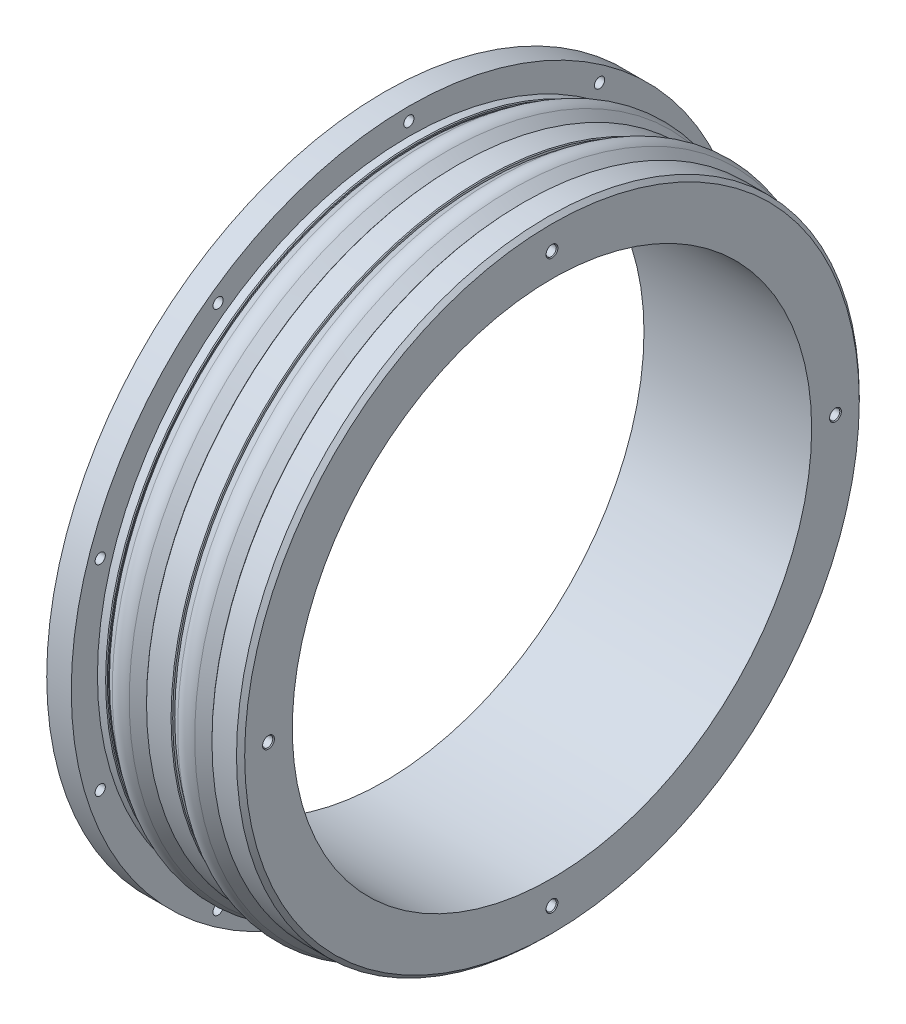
ISO-10303-21;
HEADER;
FILE_DESCRIPTION(('STEP AP214'),'2;1');
FILE_NAME('part.step','',(''),(''),'','','');
FILE_SCHEMA(('AUTOMOTIVE_DESIGN { 1 0 10303 214 1 1 1 1 }'));
ENDSEC;
DATA;
#1=APPLICATION_CONTEXT('core data for automotive mechanical design processes');
#2=APPLICATION_PROTOCOL_DEFINITION('international standard','automotive_design',2000,#1);
#3=PRODUCT_CONTEXT('',#1,'mechanical');
#4=PRODUCT('Part','Part','',(#3));
#5=PRODUCT_RELATED_PRODUCT_CATEGORY('part','',(#4));
#6=PRODUCT_DEFINITION_FORMATION('','',#4);
#7=PRODUCT_DEFINITION_CONTEXT('part definition',#1,'design');
#8=PRODUCT_DEFINITION('design','',#6,#7);
#9=PRODUCT_DEFINITION_SHAPE('','',#8);
#10=(LENGTH_UNIT() NAMED_UNIT(*) SI_UNIT(.MILLI.,.METRE.));
#11=(NAMED_UNIT(*) PLANE_ANGLE_UNIT() SI_UNIT($,.RADIAN.));
#12=(NAMED_UNIT(*) SI_UNIT($,.STERADIAN.) SOLID_ANGLE_UNIT());
#13=UNCERTAINTY_MEASURE_WITH_UNIT(LENGTH_MEASURE(1.E-05),#10,'distance_accuracy_value','');
#14=(GEOMETRIC_REPRESENTATION_CONTEXT(3) GLOBAL_UNCERTAINTY_ASSIGNED_CONTEXT((#13)) GLOBAL_UNIT_ASSIGNED_CONTEXT((#10,
#11,#12)) REPRESENTATION_CONTEXT('',''));
#15=CARTESIAN_POINT('',(0.,0.,0.));
#16=DIRECTION('',(0.,0.,1.));
#17=DIRECTION('',(1.,0.,0.));
#18=AXIS2_PLACEMENT_3D('',#15,#16,#17);
#19=CARTESIAN_POINT('',(0.750000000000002,0.,0.));
#20=DIRECTION('',(1.,0.,0.));
#21=DIRECTION('',(0.,0.,-1.));
#22=AXIS2_PLACEMENT_3D('',#19,#20,#21);
#23=TOROIDAL_SURFACE('',#22,74.321,1.24799999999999);
#24=CARTESIAN_POINT('',(0.00986624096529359,0.,0.));
#25=DIRECTION('',(1.,0.,0.));
#26=DIRECTION('',(0.,0.,-1.));
#27=AXIS2_PLACEMENT_3D('',#24,#25,#26);
#28=CIRCLE('',#27,75.3258412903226);
#29=CARTESIAN_POINT('',(0.00986624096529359,0.,-75.3258412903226));
#30=VERTEX_POINT('',#29);
#31=EDGE_CURVE('E107',#30,#30,#28,.T.);
#32=ORIENTED_EDGE('',*,*,#31,.F.);
#33=EDGE_LOOP('',(#32));
#34=FACE_BOUND('',#33,.T.);
#35=CARTESIAN_POINT('',(0.00986624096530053,0.,0.));
#36=DIRECTION('',(1.,0.,0.));
#37=DIRECTION('',(0.,0.,-1.));
#38=AXIS2_PLACEMENT_3D('',#35,#36,#37);
#39=CIRCLE('',#38,73.3161587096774);
#40=CARTESIAN_POINT('',(0.00986624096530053,0.,-73.3161587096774));
#41=VERTEX_POINT('',#40);
#42=EDGE_CURVE('E152',#41,#41,#39,.T.);
#43=ORIENTED_EDGE('',*,*,#42,.T.);
#44=EDGE_LOOP('',(#43));
#45=FACE_BOUND('',#44,.T.);
#46=ADVANCED_FACE('F35',(#34,#45),#23,.T.);
#47=CARTESIAN_POINT('',(0.750000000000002,0.,0.));
#48=DIRECTION('',(-1.,0.,0.));
#49=DIRECTION('',(0.,0.,1.));
#50=AXIS2_PLACEMENT_3D('',#47,#48,#49);
#51=CONICAL_SURFACE('',#50,72.771,0.634848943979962);
#52=ORIENTED_EDGE('',*,*,#42,.F.);
#53=EDGE_LOOP('',(#52));
#54=FACE_BOUND('',#53,.T.);
#55=CARTESIAN_POINT('',(0.750000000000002,0.,0.));
#56=DIRECTION('',(1.,0.,0.));
#57=DIRECTION('',(0.,0.,-1.));
#58=AXIS2_PLACEMENT_3D('',#55,#56,#57);
#59=CIRCLE('',#58,72.771);
#60=CARTESIAN_POINT('',(0.750000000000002,0.,-72.771));
#61=VERTEX_POINT('',#60);
#62=EDGE_CURVE('E149',#61,#61,#59,.T.);
#63=ORIENTED_EDGE('',*,*,#62,.T.);
#64=EDGE_LOOP('',(#63));
#65=FACE_BOUND('',#64,.T.);
#66=ADVANCED_FACE('F299',(#54,#65),#51,.F.);
#67=CARTESIAN_POINT('',(0.,0.,0.));
#68=DIRECTION('',(1.,0.,0.));
#69=DIRECTION('',(0.,0.,-1.));
#70=AXIS2_PLACEMENT_3D('',#67,#68,#69);
#71=CYLINDRICAL_SURFACE('',#70,72.771);
#72=CARTESIAN_POINT('',(0.200000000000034,0.,0.));
#73=DIRECTION('',(-1.,0.,0.));
#74=DIRECTION('',(0.,0.,1.));
#75=AXIS2_PLACEMENT_3D('',#72,#73,#74);
#76=CIRCLE('',#75,72.771);
#77=CARTESIAN_POINT('',(0.200000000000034,0.,72.771));
#78=VERTEX_POINT('',#77);
#79=EDGE_CURVE('E191',#78,#78,#76,.F.);
#80=ORIENTED_EDGE('',*,*,#79,.T.);
#81=EDGE_LOOP('',(#80));
#82=FACE_BOUND('',#81,.T.);
#83=ORIENTED_EDGE('',*,*,#62,.F.);
#84=EDGE_LOOP('',(#83));
#85=FACE_BOUND('',#84,.T.);
#86=ADVANCED_FACE('F305',(#82,#85),#71,.T.);
#87=CARTESIAN_POINT('',(0.,0.,0.));
#88=DIRECTION('',(-1.,0.,0.));
#89=DIRECTION('',(0.,0.,1.));
#90=AXIS2_PLACEMENT_3D('',#87,#88,#89);
#91=PLANE('',#90);
#92=CARTESIAN_POINT('',(0.,0.,0.));
#93=DIRECTION('',(-1.,0.,0.));
#94=DIRECTION('',(0.,0.,1.));
#95=AXIS2_PLACEMENT_3D('',#92,#93,#94);
#96=CIRCLE('',#95,72.571);
#97=CARTESIAN_POINT('',(0.,0.,72.571));
#98=VERTEX_POINT('',#97);
#99=EDGE_CURVE('E194',#98,#98,#96,.T.);
#100=ORIENTED_EDGE('',*,*,#99,.T.);
#101=EDGE_LOOP('',(#100));
#102=FACE_BOUND('',#101,.T.);
#103=CARTESIAN_POINT('',(0.,0.,0.));
#104=DIRECTION('',(1.,0.,0.));
#105=DIRECTION('',(0.,0.,-1.));
#106=AXIS2_PLACEMENT_3D('',#103,#104,#105);
#107=CIRCLE('',#106,63.5);
#108=CARTESIAN_POINT('',(0.,0.,-63.5));
#109=VERTEX_POINT('',#108);
#110=EDGE_CURVE('E146',#109,#109,#107,.T.);
#111=ORIENTED_EDGE('',*,*,#110,.T.);
#112=EDGE_LOOP('',(#111));
#113=FACE_BOUND('',#112,.T.);
#114=ADVANCED_FACE('F528',(#102,#113),#91,.T.);
#115=CARTESIAN_POINT('',(0.,0.,0.));
#116=DIRECTION('',(1.,0.,0.));
#117=DIRECTION('',(0.,0.,-1.));
#118=AXIS2_PLACEMENT_3D('',#115,#116,#117);
#119=CYLINDRICAL_SURFACE('',#118,63.5);
#120=CARTESIAN_POINT('',(41.,0.,0.));
#121=DIRECTION('',(1.,0.,0.));
#122=DIRECTION('',(0.,0.,-1.));
#123=AXIS2_PLACEMENT_3D('',#120,#121,#122);
#124=CIRCLE('',#123,63.5);
#125=CARTESIAN_POINT('',(41.,0.,-63.5));
#126=VERTEX_POINT('',#125);
#127=EDGE_CURVE('E143',#126,#126,#124,.T.);
#128=ORIENTED_EDGE('',*,*,#127,.T.);
#129=EDGE_LOOP('',(#128));
#130=FACE_BOUND('',#129,.T.);
#131=ORIENTED_EDGE('',*,*,#110,.F.);
#132=EDGE_LOOP('',(#131));
#133=FACE_BOUND('',#132,.T.);
#134=ADVANCED_FACE('F524',(#130,#133),#119,.F.);
#135=CARTESIAN_POINT('',(41.,0.,0.));
#136=DIRECTION('',(1.,0.,0.));
#137=DIRECTION('',(0.,0.,-1.));
#138=AXIS2_PLACEMENT_3D('',#135,#136,#137);
#139=PLANE('',#138);
#140=CARTESIAN_POINT('',(41.,0.,69.3225));
#141=DIRECTION('',(1.,0.,0.));
#142=DIRECTION('',(0.,0.,-1.));
#143=AXIS2_PLACEMENT_3D('',#140,#141,#142);
#144=CIRCLE('',#143,1.45000000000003);
#145=CARTESIAN_POINT('',(41.,0.,67.8725));
#146=VERTEX_POINT('',#145);
#147=EDGE_CURVE('E275',#146,#146,#144,.F.);
#148=ORIENTED_EDGE('',*,*,#147,.T.);
#149=EDGE_LOOP('',(#148));
#150=FACE_BOUND('',#149,.T.);
#151=CARTESIAN_POINT('',(41.,-69.3225,0.));
#152=DIRECTION('',(1.,0.,0.));
#153=DIRECTION('',(0.,0.,-1.));
#154=AXIS2_PLACEMENT_3D('',#151,#152,#153);
#155=CIRCLE('',#154,1.44999999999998);
#156=CARTESIAN_POINT('',(41.,-69.3225,-1.44999999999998));
#157=VERTEX_POINT('',#156);
#158=EDGE_CURVE('E272',#157,#157,#155,.F.);
#159=ORIENTED_EDGE('',*,*,#158,.T.);
#160=EDGE_LOOP('',(#159));
#161=FACE_BOUND('',#160,.T.);
#162=CARTESIAN_POINT('',(41.,0.,-69.3225));
#163=DIRECTION('',(1.,0.,0.));
#164=DIRECTION('',(0.,0.,-1.));
#165=AXIS2_PLACEMENT_3D('',#162,#163,#164);
#166=CIRCLE('',#165,1.45000000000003);
#167=CARTESIAN_POINT('',(41.,0.,-70.7725));
#168=VERTEX_POINT('',#167);
#169=EDGE_CURVE('E269',#168,#168,#166,.F.);
#170=ORIENTED_EDGE('',*,*,#169,.T.);
#171=EDGE_LOOP('',(#170));
#172=FACE_BOUND('',#171,.T.);
#173=CARTESIAN_POINT('',(41.,69.3225,0.));
#174=DIRECTION('',(1.,0.,0.));
#175=DIRECTION('',(0.,0.,-1.));
#176=AXIS2_PLACEMENT_3D('',#173,#174,#175);
#177=CIRCLE('',#176,1.44999999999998);
#178=CARTESIAN_POINT('',(41.,69.3225,-1.44999999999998));
#179=VERTEX_POINT('',#178);
#180=EDGE_CURVE('E266',#179,#179,#177,.F.);
#181=ORIENTED_EDGE('',*,*,#180,.T.);
#182=EDGE_LOOP('',(#181));
#183=FACE_BOUND('',#182,.T.);
#184=CARTESIAN_POINT('',(41.,0.,0.));
#185=DIRECTION('',(1.,0.,0.));
#186=DIRECTION('',(0.,0.,-1.));
#187=AXIS2_PLACEMENT_3D('',#184,#185,#186);
#188=CIRCLE('',#187,75.145);
#189=CARTESIAN_POINT('',(41.,0.,-75.145));
#190=VERTEX_POINT('',#189);
#191=EDGE_CURVE('E155',#190,#190,#188,.T.);
#192=ORIENTED_EDGE('',*,*,#191,.T.);
#193=EDGE_LOOP('',(#192));
#194=FACE_BOUND('',#193,.T.);
#195=ORIENTED_EDGE('',*,*,#127,.F.);
#196=EDGE_LOOP('',(#195));
#197=FACE_BOUND('',#196,.T.);
#198=ADVANCED_FACE('F520',(#150,#161,#172,#183,#194,#197),#139,.T.);
#199=CARTESIAN_POINT('',(0.,0.,0.));
#200=DIRECTION('',(1.,0.,0.));
#201=DIRECTION('',(0.,0.,-1.));
#202=AXIS2_PLACEMENT_3D('',#199,#200,#201);
#203=CYLINDRICAL_SURFACE('',#202,76.145);
#204=CARTESIAN_POINT('',(34.,0.,0.));
#205=DIRECTION('',(-1.,0.,0.));
#206=DIRECTION('',(0.,0.,1.));
#207=AXIS2_PLACEMENT_3D('',#204,#205,#206);
#208=CIRCLE('',#207,76.145);
#209=CARTESIAN_POINT('',(34.,0.,76.145));
#210=VERTEX_POINT('',#209);
#211=EDGE_CURVE('E173',#210,#210,#208,.F.);
#212=ORIENTED_EDGE('',*,*,#211,.T.);
#213=EDGE_LOOP('',(#212));
#214=FACE_BOUND('',#213,.T.);
#215=CARTESIAN_POINT('',(40.0000000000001,0.,0.));
#216=DIRECTION('',(1.,0.,0.));
#217=DIRECTION('',(0.,0.,-1.));
#218=AXIS2_PLACEMENT_3D('',#215,#216,#217);
#219=CIRCLE('',#218,76.145);
#220=CARTESIAN_POINT('',(40.0000000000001,0.,-76.145));
#221=VERTEX_POINT('',#220);
#222=EDGE_CURVE('E158',#221,#221,#219,.F.);
#223=ORIENTED_EDGE('',*,*,#222,.T.);
#224=EDGE_LOOP('',(#223));
#225=FACE_BOUND('',#224,.T.);
#226=ADVANCED_FACE('F516',(#214,#225),#203,.T.);
#227=CARTESIAN_POINT('',(33.8,0.,0.));
#228=DIRECTION('',(-1.,0.,0.));
#229=DIRECTION('',(0.,0.,1.));
#230=AXIS2_PLACEMENT_3D('',#227,#228,#229);
#231=PLANE('',#230);
#232=CARTESIAN_POINT('',(33.8,0.,0.));
#233=DIRECTION('',(-1.,0.,0.));
#234=DIRECTION('',(0.,0.,1.));
#235=AXIS2_PLACEMENT_3D('',#232,#233,#234);
#236=CIRCLE('',#235,75.945);
#237=CARTESIAN_POINT('',(33.8,0.,75.945));
#238=VERTEX_POINT('',#237);
#239=EDGE_CURVE('E176',#238,#238,#236,.T.);
#240=ORIENTED_EDGE('',*,*,#239,.T.);
#241=EDGE_LOOP('',(#240));
#242=FACE_BOUND('',#241,.T.);
#243=CARTESIAN_POINT('',(33.8,0.,0.));
#244=DIRECTION('',(1.,0.,0.));
#245=DIRECTION('',(0.,0.,-1.));
#246=AXIS2_PLACEMENT_3D('',#243,#244,#245);
#247=CIRCLE('',#246,75.445);
#248=CARTESIAN_POINT('',(33.8,0.,-75.445));
#249=VERTEX_POINT('',#248);
#250=EDGE_CURVE('E140',#249,#249,#247,.T.);
#251=ORIENTED_EDGE('',*,*,#250,.T.);
#252=EDGE_LOOP('',(#251));
#253=FACE_BOUND('',#252,.T.);
#254=ADVANCED_FACE('F512',(#242,#253),#231,.T.);
#255=CARTESIAN_POINT('',(31.0833480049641,0.,0.));
#256=DIRECTION('',(-1.,0.,0.));
#257=DIRECTION('',(0.,0.,1.));
#258=AXIS2_PLACEMENT_3D('',#255,#256,#257);
#259=CONICAL_SURFACE('',#258,77.4574119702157,0.63756713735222);
#260=ORIENTED_EDGE('',*,*,#250,.F.);
#261=EDGE_LOOP('',(#260));
#262=FACE_BOUND('',#261,.T.);
#263=CARTESIAN_POINT('',(31.0833480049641,0.,0.));
#264=DIRECTION('',(1.,0.,0.));
#265=DIRECTION('',(0.,0.,-1.));
#266=AXIS2_PLACEMENT_3D('',#263,#264,#265);
#267=CIRCLE('',#266,77.4574119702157);
#268=CARTESIAN_POINT('',(31.0833480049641,0.,-77.4574119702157));
#269=VERTEX_POINT('',#268);
#270=EDGE_CURVE('E137',#269,#269,#267,.T.);
#271=ORIENTED_EDGE('',*,*,#270,.T.);
#272=EDGE_LOOP('',(#271));
#273=FACE_BOUND('',#272,.T.);
#274=ADVANCED_FACE('F508',(#262,#273),#259,.T.);
#275=CARTESIAN_POINT('',(29.,0.,0.));
#276=DIRECTION('',(1.,0.,0.));
#277=DIRECTION('',(0.,0.,-1.));
#278=AXIS2_PLACEMENT_3D('',#275,#276,#277);
#279=TOROIDAL_SURFACE('',#278,74.645,3.50000000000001);
#280=ORIENTED_EDGE('',*,*,#270,.F.);
#281=EDGE_LOOP('',(#280));
#282=FACE_BOUND('',#281,.T.);
#283=CARTESIAN_POINT('',(26.916651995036,0.,0.));
#284=DIRECTION('',(1.,0.,0.));
#285=DIRECTION('',(0.,0.,-1.));
#286=AXIS2_PLACEMENT_3D('',#283,#284,#285);
#287=CIRCLE('',#286,77.4574119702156);
#288=CARTESIAN_POINT('',(26.916651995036,0.,-77.4574119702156));
#289=VERTEX_POINT('',#288);
#290=EDGE_CURVE('E134',#289,#289,#287,.T.);
#291=ORIENTED_EDGE('',*,*,#290,.T.);
#292=EDGE_LOOP('',(#291));
#293=FACE_BOUND('',#292,.T.);
#294=ADVANCED_FACE('F504',(#282,#293),#279,.T.);
#295=CARTESIAN_POINT('',(26.916651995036,0.,0.));
#296=DIRECTION('',(1.,0.,0.));
#297=DIRECTION('',(0.,0.,-1.));
#298=AXIS2_PLACEMENT_3D('',#295,#296,#297);
#299=CONICAL_SURFACE('',#298,77.4574119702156,0.63756713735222);
#300=CARTESIAN_POINT('',(24.2,0.,0.));
#301=DIRECTION('',(1.,0.,0.));
#302=DIRECTION('',(0.,0.,-1.));
#303=AXIS2_PLACEMENT_3D('',#300,#301,#302);
#304=CIRCLE('',#303,75.445);
#305=CARTESIAN_POINT('',(24.2,0.,-75.445));
#306=VERTEX_POINT('',#305);
#307=EDGE_CURVE('E131',#306,#306,#304,.T.);
#308=ORIENTED_EDGE('',*,*,#307,.T.);
#309=EDGE_LOOP('',(#308));
#310=FACE_BOUND('',#309,.T.);
#311=ORIENTED_EDGE('',*,*,#290,.F.);
#312=EDGE_LOOP('',(#311));
#313=FACE_BOUND('',#312,.T.);
#314=ADVANCED_FACE('F500',(#310,#313),#299,.T.);
#315=CARTESIAN_POINT('',(24.2,0.,0.));
#316=DIRECTION('',(-1.,0.,0.));
#317=DIRECTION('',(0.,0.,1.));
#318=AXIS2_PLACEMENT_3D('',#315,#316,#317);
#319=PLANE('',#318);
#320=CARTESIAN_POINT('',(24.2,0.,0.));
#321=DIRECTION('',(-1.,0.,0.));
#322=DIRECTION('',(0.,0.,1.));
#323=AXIS2_PLACEMENT_3D('',#320,#321,#322);
#324=CIRCLE('',#323,75.945);
#325=CARTESIAN_POINT('',(24.2,0.,75.945));
#326=VERTEX_POINT('',#325);
#327=EDGE_CURVE('E179',#326,#326,#324,.F.);
#328=ORIENTED_EDGE('',*,*,#327,.T.);
#329=EDGE_LOOP('',(#328));
#330=FACE_BOUND('',#329,.T.);
#331=ORIENTED_EDGE('',*,*,#307,.F.);
#332=EDGE_LOOP('',(#331));
#333=FACE_BOUND('',#332,.T.);
#334=ADVANCED_FACE('F496',(#330,#333),#319,.F.);
#335=CARTESIAN_POINT('',(0.,0.,0.));
#336=DIRECTION('',(1.,0.,0.));
#337=DIRECTION('',(0.,0.,-1.));
#338=AXIS2_PLACEMENT_3D('',#335,#336,#337);
#339=CYLINDRICAL_SURFACE('',#338,76.145);
#340=CARTESIAN_POINT('',(24.0000000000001,0.,0.));
#341=DIRECTION('',(-1.,0.,0.));
#342=DIRECTION('',(0.,0.,1.));
#343=AXIS2_PLACEMENT_3D('',#340,#341,#342);
#344=CIRCLE('',#343,76.145);
#345=CARTESIAN_POINT('',(24.0000000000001,0.,76.145));
#346=VERTEX_POINT('',#345);
#347=EDGE_CURVE('E185',#346,#346,#344,.T.);
#348=ORIENTED_EDGE('',*,*,#347,.T.);
#349=EDGE_LOOP('',(#348));
#350=FACE_BOUND('',#349,.T.);
#351=CARTESIAN_POINT('',(18.,0.,0.));
#352=DIRECTION('',(1.,0.,0.));
#353=DIRECTION('',(0.,0.,-1.));
#354=AXIS2_PLACEMENT_3D('',#351,#352,#353);
#355=CIRCLE('',#354,76.145);
#356=CARTESIAN_POINT('',(18.,0.,-76.145));
#357=VERTEX_POINT('',#356);
#358=EDGE_CURVE('E182',#357,#357,#355,.T.);
#359=ORIENTED_EDGE('',*,*,#358,.T.);
#360=EDGE_LOOP('',(#359));
#361=FACE_BOUND('',#360,.T.);
#362=ADVANCED_FACE('F492',(#350,#361),#339,.T.);
#363=CARTESIAN_POINT('',(17.8,0.,0.));
#364=DIRECTION('',(1.,0.,0.));
#365=DIRECTION('',(0.,0.,-1.));
#366=AXIS2_PLACEMENT_3D('',#363,#364,#365);
#367=PLANE('',#366);
#368=CARTESIAN_POINT('',(17.8,0.,0.));
#369=DIRECTION('',(1.,0.,0.));
#370=DIRECTION('',(0.,0.,-1.));
#371=AXIS2_PLACEMENT_3D('',#368,#369,#370);
#372=CIRCLE('',#371,75.945);
#373=CARTESIAN_POINT('',(17.8,0.,-75.945));
#374=VERTEX_POINT('',#373);
#375=EDGE_CURVE('E188',#374,#374,#372,.F.);
#376=ORIENTED_EDGE('',*,*,#375,.T.);
#377=EDGE_LOOP('',(#376));
#378=FACE_BOUND('',#377,.T.);
#379=CARTESIAN_POINT('',(17.8,0.,0.));
#380=DIRECTION('',(1.,0.,0.));
#381=DIRECTION('',(0.,0.,-1.));
#382=AXIS2_PLACEMENT_3D('',#379,#380,#381);
#383=CIRCLE('',#382,75.445);
#384=CARTESIAN_POINT('',(17.8,0.,-75.445));
#385=VERTEX_POINT('',#384);
#386=EDGE_CURVE('E128',#385,#385,#383,.T.);
#387=ORIENTED_EDGE('',*,*,#386,.T.);
#388=EDGE_LOOP('',(#387));
#389=FACE_BOUND('',#388,.T.);
#390=ADVANCED_FACE('F488',(#378,#389),#367,.F.);
#391=CARTESIAN_POINT('',(15.0833480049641,0.,0.));
#392=DIRECTION('',(-1.,0.,0.));
#393=DIRECTION('',(0.,0.,1.));
#394=AXIS2_PLACEMENT_3D('',#391,#392,#393);
#395=CONICAL_SURFACE('',#394,77.4574119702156,0.637567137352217);
#396=ORIENTED_EDGE('',*,*,#386,.F.);
#397=EDGE_LOOP('',(#396));
#398=FACE_BOUND('',#397,.T.);
#399=CARTESIAN_POINT('',(15.0833480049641,0.,0.));
#400=DIRECTION('',(1.,0.,0.));
#401=DIRECTION('',(0.,0.,-1.));
#402=AXIS2_PLACEMENT_3D('',#399,#400,#401);
#403=CIRCLE('',#402,77.4574119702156);
#404=CARTESIAN_POINT('',(15.0833480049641,0.,-77.4574119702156));
#405=VERTEX_POINT('',#404);
#406=EDGE_CURVE('E125',#405,#405,#403,.T.);
#407=ORIENTED_EDGE('',*,*,#406,.T.);
#408=EDGE_LOOP('',(#407));
#409=FACE_BOUND('',#408,.T.);
#410=ADVANCED_FACE('F484',(#398,#409),#395,.T.);
#411=CARTESIAN_POINT('',(13.,0.,0.));
#412=DIRECTION('',(1.,0.,0.));
#413=DIRECTION('',(0.,0.,-1.));
#414=AXIS2_PLACEMENT_3D('',#411,#412,#413);
#415=TOROIDAL_SURFACE('',#414,74.645,3.5);
#416=ORIENTED_EDGE('',*,*,#406,.F.);
#417=EDGE_LOOP('',(#416));
#418=FACE_BOUND('',#417,.T.);
#419=CARTESIAN_POINT('',(10.9166519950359,0.,0.));
#420=DIRECTION('',(1.,0.,0.));
#421=DIRECTION('',(0.,0.,-1.));
#422=AXIS2_PLACEMENT_3D('',#419,#420,#421);
#423=CIRCLE('',#422,77.4574119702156);
#424=CARTESIAN_POINT('',(10.9166519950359,0.,-77.4574119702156));
#425=VERTEX_POINT('',#424);
#426=EDGE_CURVE('E122',#425,#425,#423,.T.);
#427=ORIENTED_EDGE('',*,*,#426,.T.);
#428=EDGE_LOOP('',(#427));
#429=FACE_BOUND('',#428,.T.);
#430=ADVANCED_FACE('F480',(#418,#429),#415,.T.);
#431=CARTESIAN_POINT('',(8.20000000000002,0.,0.));
#432=DIRECTION('',(1.,0.,0.));
#433=DIRECTION('',(0.,0.,-1.));
#434=AXIS2_PLACEMENT_3D('',#431,#432,#433);
#435=CONICAL_SURFACE('',#434,75.445,0.637567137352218);
#436=CARTESIAN_POINT('',(8.31489174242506,0.,0.));
#437=DIRECTION('',(1.,0.,0.));
#438=DIRECTION('',(0.,0.,-1.));
#439=AXIS2_PLACEMENT_3D('',#436,#437,#438);
#440=CIRCLE('',#439,75.530108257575);
#441=CARTESIAN_POINT('',(8.31489174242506,0.,-75.530108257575));
#442=VERTEX_POINT('',#441);
#443=EDGE_CURVE('E170',#442,#442,#440,.T.);
#444=ORIENTED_EDGE('',*,*,#443,.T.);
#445=EDGE_LOOP('',(#444));
#446=FACE_BOUND('',#445,.T.);
#447=ORIENTED_EDGE('',*,*,#426,.F.);
#448=EDGE_LOOP('',(#447));
#449=FACE_BOUND('',#448,.T.);
#450=ADVANCED_FACE('F476',(#446,#449),#435,.T.);
#451=CARTESIAN_POINT('',(8.20000000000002,0.,0.));
#452=DIRECTION('',(-1.,0.,0.));
#453=DIRECTION('',(0.,0.,1.));
#454=AXIS2_PLACEMENT_3D('',#451,#452,#453);
#455=PLANE('',#454);
#456=CARTESIAN_POINT('',(8.20000000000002,0.,0.));
#457=DIRECTION('',(-1.,0.,0.));
#458=DIRECTION('',(0.,0.,1.));
#459=AXIS2_PLACEMENT_3D('',#456,#457,#458);
#460=CIRCLE('',#459,75.945);
#461=CARTESIAN_POINT('',(8.20000000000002,0.,75.945));
#462=VERTEX_POINT('',#461);
#463=EDGE_CURVE('E164',#462,#462,#460,.F.);
#464=ORIENTED_EDGE('',*,*,#463,.T.);
#465=EDGE_LOOP('',(#464));
#466=FACE_BOUND('',#465,.T.);
#467=CARTESIAN_POINT('',(8.20000000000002,0.,0.));
#468=DIRECTION('',(-1.,0.,0.));
#469=DIRECTION('',(0.,0.,1.));
#470=AXIS2_PLACEMENT_3D('',#467,#468,#469);
#471=CIRCLE('',#470,75.645);
#472=CARTESIAN_POINT('',(8.20000000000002,0.,75.645));
#473=VERTEX_POINT('',#472);
#474=EDGE_CURVE('E161',#473,#473,#471,.T.);
#475=ORIENTED_EDGE('',*,*,#474,.T.);
#476=EDGE_LOOP('',(#475));
#477=FACE_BOUND('',#476,.T.);
#478=ADVANCED_FACE('F472',(#466,#477),#455,.F.);
#479=CARTESIAN_POINT('',(0.,0.,0.));
#480=DIRECTION('',(1.,0.,0.));
#481=DIRECTION('',(0.,0.,-1.));
#482=AXIS2_PLACEMENT_3D('',#479,#480,#481);
#483=CYLINDRICAL_SURFACE('',#482,76.145);
#484=CARTESIAN_POINT('',(8.,0.,0.));
#485=DIRECTION('',(-1.,0.,0.));
#486=DIRECTION('',(0.,0.,1.));
#487=AXIS2_PLACEMENT_3D('',#484,#485,#486);
#488=CIRCLE('',#487,76.145);
#489=CARTESIAN_POINT('',(8.,0.,76.145));
#490=VERTEX_POINT('',#489);
#491=EDGE_CURVE('E167',#490,#490,#488,.T.);
#492=ORIENTED_EDGE('',*,*,#491,.T.);
#493=EDGE_LOOP('',(#492));
#494=FACE_BOUND('',#493,.T.);
#495=CARTESIAN_POINT('',(6.,0.,0.));
#496=DIRECTION('',(1.,0.,0.));
#497=DIRECTION('',(0.,0.,-1.));
#498=AXIS2_PLACEMENT_3D('',#495,#496,#497);
#499=CIRCLE('',#498,76.145);
#500=CARTESIAN_POINT('',(6.,0.,-76.145));
#501=VERTEX_POINT('',#500);
#502=EDGE_CURVE('E119',#501,#501,#499,.T.);
#503=ORIENTED_EDGE('',*,*,#502,.T.);
#504=EDGE_LOOP('',(#503));
#505=FACE_BOUND('',#504,.T.);
#506=ADVANCED_FACE('F468',(#494,#505),#483,.T.);
#507=CARTESIAN_POINT('',(6.,0.,0.));
#508=DIRECTION('',(1.,0.,0.));
#509=DIRECTION('',(0.,0.,-1.));
#510=AXIS2_PLACEMENT_3D('',#507,#508,#509);
#511=PLANE('',#510);
#512=CARTESIAN_POINT('',(6.,79.35,0.));
#513=DIRECTION('',(1.,0.,0.));
#514=DIRECTION('',(0.,0.,-1.));
#515=AXIS2_PLACEMENT_3D('',#512,#513,#514);
#516=CIRCLE('',#515,1.24999999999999);
#517=CARTESIAN_POINT('',(6.,79.35,-1.24999999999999));
#518=VERTEX_POINT('',#517);
#519=EDGE_CURVE('E77',#518,#518,#516,.T.);
#520=ORIENTED_EDGE('',*,*,#519,.F.);
#521=EDGE_LOOP('',(#520));
#522=FACE_BOUND('',#521,.T.);
#523=CARTESIAN_POINT('',(6.,64.1954985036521,-46.6407597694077));
#524=DIRECTION('',(1.,0.,0.));
#525=DIRECTION('',(0.,0.,-1.));
#526=AXIS2_PLACEMENT_3D('',#523,#524,#525);
#527=CIRCLE('',#526,1.24999999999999);
#528=CARTESIAN_POINT('',(6.,64.1954985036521,-47.8907597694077));
#529=VERTEX_POINT('',#528);
#530=EDGE_CURVE('E80',#529,#529,#527,.T.);
#531=ORIENTED_EDGE('',*,*,#530,.F.);
#532=EDGE_LOOP('',(#531));
#533=FACE_BOUND('',#532,.T.);
#534=CARTESIAN_POINT('',(6.,24.5204985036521,-75.4663345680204));
#535=DIRECTION('',(1.,0.,0.));
#536=DIRECTION('',(0.,0.,-1.));
#537=AXIS2_PLACEMENT_3D('',#534,#535,#536);
#538=CIRCLE('',#537,1.24999999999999);
#539=CARTESIAN_POINT('',(6.,24.5204985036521,-76.7163345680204));
#540=VERTEX_POINT('',#539);
#541=EDGE_CURVE('E83',#540,#540,#538,.T.);
#542=ORIENTED_EDGE('',*,*,#541,.F.);
#543=EDGE_LOOP('',(#542));
#544=FACE_BOUND('',#543,.T.);
#545=CARTESIAN_POINT('',(6.,-24.5204985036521,-75.4663345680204));
#546=DIRECTION('',(1.,0.,0.));
#547=DIRECTION('',(0.,0.,-1.));
#548=AXIS2_PLACEMENT_3D('',#545,#546,#547);
#549=CIRCLE('',#548,1.24999999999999);
#550=CARTESIAN_POINT('',(6.,-24.5204985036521,-76.7163345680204));
#551=VERTEX_POINT('',#550);
#552=EDGE_CURVE('E86',#551,#551,#549,.T.);
#553=ORIENTED_EDGE('',*,*,#552,.F.);
#554=EDGE_LOOP('',(#553));
#555=FACE_BOUND('',#554,.T.);
#556=CARTESIAN_POINT('',(6.,-64.1954985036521,-46.6407597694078));
#557=DIRECTION('',(1.,0.,0.));
#558=DIRECTION('',(0.,0.,-1.));
#559=AXIS2_PLACEMENT_3D('',#556,#557,#558);
#560=CIRCLE('',#559,1.24999999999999);
#561=CARTESIAN_POINT('',(6.,-64.1954985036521,-47.8907597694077));
#562=VERTEX_POINT('',#561);
#563=EDGE_CURVE('E89',#562,#562,#560,.T.);
#564=ORIENTED_EDGE('',*,*,#563,.F.);
#565=EDGE_LOOP('',(#564));
#566=FACE_BOUND('',#565,.T.);
#567=CARTESIAN_POINT('',(6.,-79.35,0.));
#568=DIRECTION('',(1.,0.,0.));
#569=DIRECTION('',(0.,0.,-1.));
#570=AXIS2_PLACEMENT_3D('',#567,#568,#569);
#571=CIRCLE('',#570,1.24999999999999);
#572=CARTESIAN_POINT('',(6.,-79.35,-1.25));
#573=VERTEX_POINT('',#572);
#574=EDGE_CURVE('E92',#573,#573,#571,.T.);
#575=ORIENTED_EDGE('',*,*,#574,.F.);
#576=EDGE_LOOP('',(#575));
#577=FACE_BOUND('',#576,.T.);
#578=CARTESIAN_POINT('',(6.,-64.1954985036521,46.6407597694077));
#579=DIRECTION('',(1.,0.,0.));
#580=DIRECTION('',(0.,0.,-1.));
#581=AXIS2_PLACEMENT_3D('',#578,#579,#580);
#582=CIRCLE('',#581,1.24999999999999);
#583=CARTESIAN_POINT('',(6.,-64.1954985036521,45.3907597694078));
#584=VERTEX_POINT('',#583);
#585=EDGE_CURVE('E95',#584,#584,#582,.T.);
#586=ORIENTED_EDGE('',*,*,#585,.F.);
#587=EDGE_LOOP('',(#586));
#588=FACE_BOUND('',#587,.T.);
#589=CARTESIAN_POINT('',(6.,-24.5204985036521,75.4663345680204));
#590=DIRECTION('',(1.,0.,0.));
#591=DIRECTION('',(0.,0.,-1.));
#592=AXIS2_PLACEMENT_3D('',#589,#590,#591);
#593=CIRCLE('',#592,1.24999999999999);
#594=CARTESIAN_POINT('',(6.,-24.5204985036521,74.2163345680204));
#595=VERTEX_POINT('',#594);
#596=EDGE_CURVE('E98',#595,#595,#593,.T.);
#597=ORIENTED_EDGE('',*,*,#596,.F.);
#598=EDGE_LOOP('',(#597));
#599=FACE_BOUND('',#598,.T.);
#600=CARTESIAN_POINT('',(6.,24.5204985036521,75.4663345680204));
#601=DIRECTION('',(1.,0.,0.));
#602=DIRECTION('',(0.,0.,-1.));
#603=AXIS2_PLACEMENT_3D('',#600,#601,#602);
#604=CIRCLE('',#603,1.24999999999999);
#605=CARTESIAN_POINT('',(6.,24.5204985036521,74.2163345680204));
#606=VERTEX_POINT('',#605);
#607=EDGE_CURVE('E101',#606,#606,#604,.T.);
#608=ORIENTED_EDGE('',*,*,#607,.F.);
#609=EDGE_LOOP('',(#608));
#610=FACE_BOUND('',#609,.T.);
#611=CARTESIAN_POINT('',(6.,64.1954985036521,46.6407597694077));
#612=DIRECTION('',(1.,0.,0.));
#613=DIRECTION('',(0.,0.,-1.));
#614=AXIS2_PLACEMENT_3D('',#611,#612,#613);
#615=CIRCLE('',#614,1.24999999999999);
#616=CARTESIAN_POINT('',(6.,64.1954985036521,45.3907597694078));
#617=VERTEX_POINT('',#616);
#618=EDGE_CURVE('E104',#617,#617,#615,.T.);
#619=ORIENTED_EDGE('',*,*,#618,.F.);
#620=EDGE_LOOP('',(#619));
#621=FACE_BOUND('',#620,.T.);
#622=CARTESIAN_POINT('',(6.,0.,0.));
#623=DIRECTION('',(1.,0.,0.));
#624=DIRECTION('',(0.,0.,-1.));
#625=AXIS2_PLACEMENT_3D('',#622,#623,#624);
#626=CIRCLE('',#625,82.55);
#627=CARTESIAN_POINT('',(6.,0.,-82.55));
#628=VERTEX_POINT('',#627);
#629=EDGE_CURVE('E116',#628,#628,#626,.T.);
#630=ORIENTED_EDGE('',*,*,#629,.T.);
#631=EDGE_LOOP('',(#630));
#632=FACE_BOUND('',#631,.T.);
#633=ORIENTED_EDGE('',*,*,#502,.F.);
#634=EDGE_LOOP('',(#633));
#635=FACE_BOUND('',#634,.T.);
#636=ADVANCED_FACE('F464',(#522,#533,#544,#555,#566,#577,#588,#599,#610,#621,#632,#635),#511,.T.);
#637=CARTESIAN_POINT('',(0.,0.,0.));
#638=DIRECTION('',(1.,0.,0.));
#639=DIRECTION('',(0.,0.,-1.));
#640=AXIS2_PLACEMENT_3D('',#637,#638,#639);
#641=CYLINDRICAL_SURFACE('',#640,82.55);
#642=CARTESIAN_POINT('',(0.,0.,0.));
#643=DIRECTION('',(1.,0.,0.));
#644=DIRECTION('',(0.,0.,-1.));
#645=AXIS2_PLACEMENT_3D('',#642,#643,#644);
#646=CIRCLE('',#645,82.55);
#647=CARTESIAN_POINT('',(0.,0.,-82.55));
#648=VERTEX_POINT('',#647);
#649=EDGE_CURVE('E113',#648,#648,#646,.T.);
#650=ORIENTED_EDGE('',*,*,#649,.T.);
#651=EDGE_LOOP('',(#650));
#652=FACE_BOUND('',#651,.T.);
#653=ORIENTED_EDGE('',*,*,#629,.F.);
#654=EDGE_LOOP('',(#653));
#655=FACE_BOUND('',#654,.T.);
#656=ADVANCED_FACE('F460',(#652,#655),#641,.T.);
#657=CARTESIAN_POINT('',(0.,0.,0.));
#658=DIRECTION('',(-1.,0.,0.));
#659=DIRECTION('',(0.,0.,1.));
#660=AXIS2_PLACEMENT_3D('',#657,#658,#659);
#661=PLANE('',#660);
#662=CARTESIAN_POINT('',(0.,24.5204985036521,75.4663345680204));
#663=DIRECTION('',(-1.,0.,0.));
#664=DIRECTION('',(0.,0.,1.));
#665=AXIS2_PLACEMENT_3D('',#662,#663,#664);
#666=CIRCLE('',#665,1.44999999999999);
#667=CARTESIAN_POINT('',(0.,24.5204985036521,76.9163345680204));
#668=VERTEX_POINT('',#667);
#669=EDGE_CURVE('E233',#668,#668,#666,.F.);
#670=ORIENTED_EDGE('',*,*,#669,.T.);
#671=EDGE_LOOP('',(#670));
#672=FACE_BOUND('',#671,.T.);
#673=CARTESIAN_POINT('',(0.,64.1954985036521,46.6407597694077));
#674=DIRECTION('',(-1.,0.,0.));
#675=DIRECTION('',(0.,0.,1.));
#676=AXIS2_PLACEMENT_3D('',#673,#674,#675);
#677=CIRCLE('',#676,1.45);
#678=CARTESIAN_POINT('',(0.,64.1954985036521,48.0907597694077));
#679=VERTEX_POINT('',#678);
#680=EDGE_CURVE('E230',#679,#679,#677,.F.);
#681=ORIENTED_EDGE('',*,*,#680,.T.);
#682=EDGE_LOOP('',(#681));
#683=FACE_BOUND('',#682,.T.);
#684=CARTESIAN_POINT('',(0.,79.35,0.));
#685=DIRECTION('',(-1.,0.,0.));
#686=DIRECTION('',(0.,0.,1.));
#687=AXIS2_PLACEMENT_3D('',#684,#685,#686);
#688=CIRCLE('',#687,1.45);
#689=CARTESIAN_POINT('',(0.,79.35,1.45));
#690=VERTEX_POINT('',#689);
#691=EDGE_CURVE('E227',#690,#690,#688,.F.);
#692=ORIENTED_EDGE('',*,*,#691,.T.);
#693=EDGE_LOOP('',(#692));
#694=FACE_BOUND('',#693,.T.);
#695=CARTESIAN_POINT('',(0.,64.1954985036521,-46.6407597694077));
#696=DIRECTION('',(-1.,0.,0.));
#697=DIRECTION('',(0.,0.,1.));
#698=AXIS2_PLACEMENT_3D('',#695,#696,#697);
#699=CIRCLE('',#698,1.45);
#700=CARTESIAN_POINT('',(0.,64.1954985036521,-45.1907597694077));
#701=VERTEX_POINT('',#700);
#702=EDGE_CURVE('E224',#701,#701,#699,.F.);
#703=ORIENTED_EDGE('',*,*,#702,.T.);
#704=EDGE_LOOP('',(#703));
#705=FACE_BOUND('',#704,.T.);
#706=CARTESIAN_POINT('',(0.,24.5204985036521,-75.4663345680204));
#707=DIRECTION('',(-1.,0.,0.));
#708=DIRECTION('',(0.,0.,1.));
#709=AXIS2_PLACEMENT_3D('',#706,#707,#708);
#710=CIRCLE('',#709,1.44999999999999);
#711=CARTESIAN_POINT('',(0.,24.5204985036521,-74.0163345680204));
#712=VERTEX_POINT('',#711);
#713=EDGE_CURVE('E221',#712,#712,#710,.F.);
#714=ORIENTED_EDGE('',*,*,#713,.T.);
#715=EDGE_LOOP('',(#714));
#716=FACE_BOUND('',#715,.T.);
#717=CARTESIAN_POINT('',(0.,-24.5204985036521,-75.4663345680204));
#718=DIRECTION('',(-1.,0.,0.));
#719=DIRECTION('',(0.,0.,1.));
#720=AXIS2_PLACEMENT_3D('',#717,#718,#719);
#721=CIRCLE('',#720,1.44999999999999);
#722=CARTESIAN_POINT('',(0.,-24.5204985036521,-74.0163345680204));
#723=VERTEX_POINT('',#722);
#724=EDGE_CURVE('E218',#723,#723,#721,.F.);
#725=ORIENTED_EDGE('',*,*,#724,.T.);
#726=EDGE_LOOP('',(#725));
#727=FACE_BOUND('',#726,.T.);
#728=CARTESIAN_POINT('',(0.,-64.1954985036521,-46.6407597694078));
#729=DIRECTION('',(-1.,0.,0.));
#730=DIRECTION('',(0.,0.,1.));
#731=AXIS2_PLACEMENT_3D('',#728,#729,#730);
#732=CIRCLE('',#731,1.45);
#733=CARTESIAN_POINT('',(0.,-64.1954985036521,-45.1907597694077));
#734=VERTEX_POINT('',#733);
#735=EDGE_CURVE('E215',#734,#734,#732,.F.);
#736=ORIENTED_EDGE('',*,*,#735,.T.);
#737=EDGE_LOOP('',(#736));
#738=FACE_BOUND('',#737,.T.);
#739=CARTESIAN_POINT('',(0.,-79.35,0.));
#740=DIRECTION('',(-1.,0.,0.));
#741=DIRECTION('',(0.,0.,1.));
#742=AXIS2_PLACEMENT_3D('',#739,#740,#741);
#743=CIRCLE('',#742,1.45);
#744=CARTESIAN_POINT('',(0.,-79.35,1.44999999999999));
#745=VERTEX_POINT('',#744);
#746=EDGE_CURVE('E212',#745,#745,#743,.F.);
#747=ORIENTED_EDGE('',*,*,#746,.T.);
#748=EDGE_LOOP('',(#747));
#749=FACE_BOUND('',#748,.T.);
#750=CARTESIAN_POINT('',(0.,-64.1954985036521,46.6407597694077));
#751=DIRECTION('',(-1.,0.,0.));
#752=DIRECTION('',(0.,0.,1.));
#753=AXIS2_PLACEMENT_3D('',#750,#751,#752);
#754=CIRCLE('',#753,1.45);
#755=CARTESIAN_POINT('',(0.,-64.1954985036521,48.0907597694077));
#756=VERTEX_POINT('',#755);
#757=EDGE_CURVE('E209',#756,#756,#754,.F.);
#758=ORIENTED_EDGE('',*,*,#757,.T.);
#759=EDGE_LOOP('',(#758));
#760=FACE_BOUND('',#759,.T.);
#761=CARTESIAN_POINT('',(0.,-24.5204985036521,75.4663345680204));
#762=DIRECTION('',(-1.,0.,0.));
#763=DIRECTION('',(0.,0.,1.));
#764=AXIS2_PLACEMENT_3D('',#761,#762,#763);
#765=CIRCLE('',#764,1.44999999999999);
#766=CARTESIAN_POINT('',(0.,-24.5204985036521,76.9163345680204));
#767=VERTEX_POINT('',#766);
#768=EDGE_CURVE('E206',#767,#767,#765,.F.);
#769=ORIENTED_EDGE('',*,*,#768,.T.);
#770=EDGE_LOOP('',(#769));
#771=FACE_BOUND('',#770,.T.);
#772=CARTESIAN_POINT('',(0.,0.,0.));
#773=DIRECTION('',(-1.,0.,0.));
#774=DIRECTION('',(0.,0.,1.));
#775=AXIS2_PLACEMENT_3D('',#772,#773,#774);
#776=CIRCLE('',#775,76.071);
#777=CARTESIAN_POINT('',(0.,0.,76.071));
#778=VERTEX_POINT('',#777);
#779=EDGE_CURVE('E197',#778,#778,#776,.F.);
#780=ORIENTED_EDGE('',*,*,#779,.T.);
#781=EDGE_LOOP('',(#780));
#782=FACE_BOUND('',#781,.T.);
#783=ORIENTED_EDGE('',*,*,#649,.F.);
#784=EDGE_LOOP('',(#783));
#785=FACE_BOUND('',#784,.T.);
#786=ADVANCED_FACE('F456',(#672,#683,#694,#705,#716,#727,#738,#749,#760,#771,#782,#785),#661,.T.);
#787=CARTESIAN_POINT('',(0.,0.,0.));
#788=DIRECTION('',(1.,0.,0.));
#789=DIRECTION('',(0.,0.,-1.));
#790=AXIS2_PLACEMENT_3D('',#787,#788,#789);
#791=CYLINDRICAL_SURFACE('',#790,75.871);
#792=CARTESIAN_POINT('',(0.199999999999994,0.,0.));
#793=DIRECTION('',(-1.,0.,0.));
#794=DIRECTION('',(0.,0.,1.));
#795=AXIS2_PLACEMENT_3D('',#792,#793,#794);
#796=CIRCLE('',#795,75.871);
#797=CARTESIAN_POINT('',(0.199999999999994,0.,75.871));
#798=VERTEX_POINT('',#797);
#799=EDGE_CURVE('E200',#798,#798,#796,.T.);
#800=ORIENTED_EDGE('',*,*,#799,.T.);
#801=EDGE_LOOP('',(#800));
#802=FACE_BOUND('',#801,.T.);
#803=CARTESIAN_POINT('',(0.750000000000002,0.,0.));
#804=DIRECTION('',(1.,0.,0.));
#805=DIRECTION('',(0.,0.,-1.));
#806=AXIS2_PLACEMENT_3D('',#803,#804,#805);
#807=CIRCLE('',#806,75.871);
#808=CARTESIAN_POINT('',(0.750000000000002,0.,-75.871));
#809=VERTEX_POINT('',#808);
#810=EDGE_CURVE('E110',#809,#809,#807,.T.);
#811=ORIENTED_EDGE('',*,*,#810,.T.);
#812=EDGE_LOOP('',(#811));
#813=FACE_BOUND('',#812,.T.);
#814=ADVANCED_FACE('F452',(#802,#813),#791,.F.);
#815=CARTESIAN_POINT('',(0.750000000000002,0.,0.));
#816=DIRECTION('',(1.,0.,0.));
#817=DIRECTION('',(0.,0.,-1.));
#818=AXIS2_PLACEMENT_3D('',#815,#816,#817);
#819=CONICAL_SURFACE('',#818,75.871,0.634848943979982);
#820=ORIENTED_EDGE('',*,*,#31,.T.);
#821=EDGE_LOOP('',(#820));
#822=FACE_BOUND('',#821,.T.);
#823=ORIENTED_EDGE('',*,*,#810,.F.);
#824=EDGE_LOOP('',(#823));
#825=FACE_BOUND('',#824,.T.);
#826=ADVANCED_FACE('F316',(#822,#825),#819,.T.);
#827=CARTESIAN_POINT('',(41.,0.,0.));
#828=DIRECTION('',(-1.,0.,0.));
#829=DIRECTION('',(0.,0.,1.));
#830=AXIS2_PLACEMENT_3D('',#827,#828,#829);
#831=CONICAL_SURFACE('',#830,75.145,0.785398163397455);
#832=ORIENTED_EDGE('',*,*,#222,.F.);
#833=EDGE_LOOP('',(#832));
#834=FACE_BOUND('',#833,.T.);
#835=ORIENTED_EDGE('',*,*,#191,.F.);
#836=EDGE_LOOP('',(#835));
#837=FACE_BOUND('',#836,.T.);
#838=ADVANCED_FACE('F312',(#834,#837),#831,.T.);
#839=CARTESIAN_POINT('',(8.20000000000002,0.,0.));
#840=DIRECTION('',(-1.,0.,0.));
#841=DIRECTION('',(0.,0.,1.));
#842=AXIS2_PLACEMENT_3D('',#839,#840,#841);
#843=CONICAL_SURFACE('',#842,75.945,0.785398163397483);
#844=ORIENTED_EDGE('',*,*,#491,.F.);
#845=EDGE_LOOP('',(#844));
#846=FACE_BOUND('',#845,.T.);
#847=ORIENTED_EDGE('',*,*,#463,.F.);
#848=EDGE_LOOP('',(#847));
#849=FACE_BOUND('',#848,.T.);
#850=ADVANCED_FACE('F315',(#846,#849),#843,.T.);
#851=CARTESIAN_POINT('',(8.31489174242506,0.,0.));
#852=DIRECTION('',(-1.,0.,0.));
#853=DIRECTION('',(0.,0.,1.));
#854=AXIS2_PLACEMENT_3D('',#851,#852,#853);
#855=CONICAL_SURFACE('',#854,75.530108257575,0.785398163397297);
#856=ORIENTED_EDGE('',*,*,#474,.F.);
#857=EDGE_LOOP('',(#856));
#858=FACE_BOUND('',#857,.T.);
#859=ORIENTED_EDGE('',*,*,#443,.F.);
#860=EDGE_LOOP('',(#859));
#861=FACE_BOUND('',#860,.T.);
#862=ADVANCED_FACE('F320',(#858,#861),#855,.T.);
#863=CARTESIAN_POINT('',(34.,0.,0.));
#864=DIRECTION('',(1.,0.,0.));
#865=DIRECTION('',(0.,0.,-1.));
#866=AXIS2_PLACEMENT_3D('',#863,#864,#865);
#867=CONICAL_SURFACE('',#866,76.145,0.785398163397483);
#868=ORIENTED_EDGE('',*,*,#239,.F.);
#869=EDGE_LOOP('',(#868));
#870=FACE_BOUND('',#869,.T.);
#871=ORIENTED_EDGE('',*,*,#211,.F.);
#872=EDGE_LOOP('',(#871));
#873=FACE_BOUND('',#872,.T.);
#874=ADVANCED_FACE('F324',(#870,#873),#867,.T.);
#875=CARTESIAN_POINT('',(24.2,0.,0.));
#876=DIRECTION('',(-1.,0.,0.));
#877=DIRECTION('',(0.,0.,1.));
#878=AXIS2_PLACEMENT_3D('',#875,#876,#877);
#879=CONICAL_SURFACE('',#878,75.945,0.785398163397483);
#880=ORIENTED_EDGE('',*,*,#347,.F.);
#881=EDGE_LOOP('',(#880));
#882=FACE_BOUND('',#881,.T.);
#883=ORIENTED_EDGE('',*,*,#327,.F.);
#884=EDGE_LOOP('',(#883));
#885=FACE_BOUND('',#884,.T.);
#886=ADVANCED_FACE('F328',(#882,#885),#879,.T.);
#887=CARTESIAN_POINT('',(18.,0.,0.));
#888=DIRECTION('',(1.,0.,0.));
#889=DIRECTION('',(0.,0.,-1.));
#890=AXIS2_PLACEMENT_3D('',#887,#888,#889);
#891=CONICAL_SURFACE('',#890,76.145,0.785398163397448);
#892=ORIENTED_EDGE('',*,*,#375,.F.);
#893=EDGE_LOOP('',(#892));
#894=FACE_BOUND('',#893,.T.);
#895=ORIENTED_EDGE('',*,*,#358,.F.);
#896=EDGE_LOOP('',(#895));
#897=FACE_BOUND('',#896,.T.);
#898=ADVANCED_FACE('F332',(#894,#897),#891,.T.);
#899=CARTESIAN_POINT('',(0.200000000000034,0.,0.));
#900=DIRECTION('',(1.,0.,0.));
#901=DIRECTION('',(0.,0.,-1.));
#902=AXIS2_PLACEMENT_3D('',#899,#900,#901);
#903=CONICAL_SURFACE('',#902,72.771,0.785398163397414);
#904=ORIENTED_EDGE('',*,*,#99,.F.);
#905=EDGE_LOOP('',(#904));
#906=FACE_BOUND('',#905,.T.);
#907=ORIENTED_EDGE('',*,*,#79,.F.);
#908=EDGE_LOOP('',(#907));
#909=FACE_BOUND('',#908,.T.);
#910=ADVANCED_FACE('F336',(#906,#909),#903,.T.);
#911=CARTESIAN_POINT('',(0.,0.,0.));
#912=DIRECTION('',(-1.,0.,0.));
#913=DIRECTION('',(0.,0.,1.));
#914=AXIS2_PLACEMENT_3D('',#911,#912,#913);
#915=CONICAL_SURFACE('',#914,76.071,0.785398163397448);
#916=ORIENTED_EDGE('',*,*,#799,.F.);
#917=EDGE_LOOP('',(#916));
#918=FACE_BOUND('',#917,.T.);
#919=ORIENTED_EDGE('',*,*,#779,.F.);
#920=EDGE_LOOP('',(#919));
#921=FACE_BOUND('',#920,.T.);
#922=ADVANCED_FACE('F340',(#918,#921),#915,.F.);
#923=CARTESIAN_POINT('',(6.,64.1954985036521,46.6407597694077));
#924=DIRECTION('',(1.,0.,0.));
#925=DIRECTION('',(0.,0.,-1.));
#926=AXIS2_PLACEMENT_3D('',#923,#924,#925);
#927=CYLINDRICAL_SURFACE('',#926,1.24999999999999);
#928=CARTESIAN_POINT('',(0.200000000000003,64.1954985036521,46.6407597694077));
#929=DIRECTION('',(-1.,0.,0.));
#930=DIRECTION('',(0.,0.,1.));
#931=AXIS2_PLACEMENT_3D('',#928,#929,#930);
#932=CIRCLE('',#931,1.24999999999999);
#933=CARTESIAN_POINT('',(0.200000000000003,64.1954985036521,47.8907597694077));
#934=VERTEX_POINT('',#933);
#935=EDGE_CURVE('E236',#934,#934,#932,.T.);
#936=ORIENTED_EDGE('',*,*,#935,.T.);
#937=EDGE_LOOP('',(#936));
#938=FACE_BOUND('',#937,.T.);
#939=ORIENTED_EDGE('',*,*,#618,.T.);
#940=EDGE_LOOP('',(#939));
#941=FACE_BOUND('',#940,.T.);
#942=ADVANCED_FACE('F344',(#938,#941),#927,.F.);
#943=CARTESIAN_POINT('',(6.,24.5204985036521,75.4663345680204));
#944=DIRECTION('',(1.,0.,0.));
#945=DIRECTION('',(0.,0.,-1.));
#946=AXIS2_PLACEMENT_3D('',#943,#944,#945);
#947=CYLINDRICAL_SURFACE('',#946,1.24999999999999);
#948=CARTESIAN_POINT('',(0.200000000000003,24.5204985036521,75.4663345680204));
#949=DIRECTION('',(-1.,0.,0.));
#950=DIRECTION('',(0.,0.,1.));
#951=AXIS2_PLACEMENT_3D('',#948,#949,#950);
#952=CIRCLE('',#951,1.24999999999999);
#953=CARTESIAN_POINT('',(0.200000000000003,24.5204985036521,76.7163345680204));
#954=VERTEX_POINT('',#953);
#955=EDGE_CURVE('E203',#954,#954,#952,.T.);
#956=ORIENTED_EDGE('',*,*,#955,.T.);
#957=EDGE_LOOP('',(#956));
#958=FACE_BOUND('',#957,.T.);
#959=ORIENTED_EDGE('',*,*,#607,.T.);
#960=EDGE_LOOP('',(#959));
#961=FACE_BOUND('',#960,.T.);
#962=ADVANCED_FACE('F442',(#958,#961),#947,.F.);
#963=CARTESIAN_POINT('',(6.,-24.5204985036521,75.4663345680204));
#964=DIRECTION('',(1.,0.,0.));
#965=DIRECTION('',(0.,0.,-1.));
#966=AXIS2_PLACEMENT_3D('',#963,#964,#965);
#967=CYLINDRICAL_SURFACE('',#966,1.24999999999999);
#968=CARTESIAN_POINT('',(0.200000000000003,-24.5204985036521,75.4663345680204));
#969=DIRECTION('',(-1.,0.,0.));
#970=DIRECTION('',(0.,0.,1.));
#971=AXIS2_PLACEMENT_3D('',#968,#969,#970);
#972=CIRCLE('',#971,1.24999999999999);
#973=CARTESIAN_POINT('',(0.200000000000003,-24.5204985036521,76.7163345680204));
#974=VERTEX_POINT('',#973);
#975=EDGE_CURVE('E260',#974,#974,#972,.T.);
#976=ORIENTED_EDGE('',*,*,#975,.T.);
#977=EDGE_LOOP('',(#976));
#978=FACE_BOUND('',#977,.T.);
#979=ORIENTED_EDGE('',*,*,#596,.T.);
#980=EDGE_LOOP('',(#979));
#981=FACE_BOUND('',#980,.T.);
#982=ADVANCED_FACE('F438',(#978,#981),#967,.F.);
#983=CARTESIAN_POINT('',(6.,-64.1954985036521,46.6407597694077));
#984=DIRECTION('',(1.,0.,0.));
#985=DIRECTION('',(0.,0.,-1.));
#986=AXIS2_PLACEMENT_3D('',#983,#984,#985);
#987=CYLINDRICAL_SURFACE('',#986,1.24999999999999);
#988=CARTESIAN_POINT('',(0.200000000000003,-64.1954985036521,46.6407597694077));
#989=DIRECTION('',(-1.,0.,0.));
#990=DIRECTION('',(0.,0.,1.));
#991=AXIS2_PLACEMENT_3D('',#988,#989,#990);
#992=CIRCLE('',#991,1.24999999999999);
#993=CARTESIAN_POINT('',(0.200000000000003,-64.1954985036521,47.8907597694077));
#994=VERTEX_POINT('',#993);
#995=EDGE_CURVE('E257',#994,#994,#992,.T.);
#996=ORIENTED_EDGE('',*,*,#995,.T.);
#997=EDGE_LOOP('',(#996));
#998=FACE_BOUND('',#997,.T.);
#999=ORIENTED_EDGE('',*,*,#585,.T.);
#1000=EDGE_LOOP('',(#999));
#1001=FACE_BOUND('',#1000,.T.);
#1002=ADVANCED_FACE('F434',(#998,#1001),#987,.F.);
#1003=CARTESIAN_POINT('',(6.,-79.35,0.));
#1004=DIRECTION('',(1.,0.,0.));
#1005=DIRECTION('',(0.,0.,-1.));
#1006=AXIS2_PLACEMENT_3D('',#1003,#1004,#1005);
#1007=CYLINDRICAL_SURFACE('',#1006,1.24999999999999);
#1008=CARTESIAN_POINT('',(0.200000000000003,-79.35,0.));
#1009=DIRECTION('',(-1.,0.,0.));
#1010=DIRECTION('',(0.,0.,1.));
#1011=AXIS2_PLACEMENT_3D('',#1008,#1009,#1010);
#1012=CIRCLE('',#1011,1.24999999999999);
#1013=CARTESIAN_POINT('',(0.200000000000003,-79.35,1.24999999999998));
#1014=VERTEX_POINT('',#1013);
#1015=EDGE_CURVE('E254',#1014,#1014,#1012,.T.);
#1016=ORIENTED_EDGE('',*,*,#1015,.T.);
#1017=EDGE_LOOP('',(#1016));
#1018=FACE_BOUND('',#1017,.T.);
#1019=ORIENTED_EDGE('',*,*,#574,.T.);
#1020=EDGE_LOOP('',(#1019));
#1021=FACE_BOUND('',#1020,.T.);
#1022=ADVANCED_FACE('F430',(#1018,#1021),#1007,.F.);
#1023=CARTESIAN_POINT('',(6.,-64.1954985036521,-46.6407597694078));
#1024=DIRECTION('',(1.,0.,0.));
#1025=DIRECTION('',(0.,0.,-1.));
#1026=AXIS2_PLACEMENT_3D('',#1023,#1024,#1025);
#1027=CYLINDRICAL_SURFACE('',#1026,1.24999999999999);
#1028=CARTESIAN_POINT('',(0.200000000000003,-64.1954985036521,-46.6407597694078));
#1029=DIRECTION('',(-1.,0.,0.));
#1030=DIRECTION('',(0.,0.,1.));
#1031=AXIS2_PLACEMENT_3D('',#1028,#1029,#1030);
#1032=CIRCLE('',#1031,1.24999999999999);
#1033=CARTESIAN_POINT('',(0.200000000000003,-64.1954985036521,-45.3907597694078));
#1034=VERTEX_POINT('',#1033);
#1035=EDGE_CURVE('E251',#1034,#1034,#1032,.T.);
#1036=ORIENTED_EDGE('',*,*,#1035,.T.);
#1037=EDGE_LOOP('',(#1036));
#1038=FACE_BOUND('',#1037,.T.);
#1039=ORIENTED_EDGE('',*,*,#563,.T.);
#1040=EDGE_LOOP('',(#1039));
#1041=FACE_BOUND('',#1040,.T.);
#1042=ADVANCED_FACE('F426',(#1038,#1041),#1027,.F.);
#1043=CARTESIAN_POINT('',(6.,-24.5204985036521,-75.4663345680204));
#1044=DIRECTION('',(1.,0.,0.));
#1045=DIRECTION('',(0.,0.,-1.));
#1046=AXIS2_PLACEMENT_3D('',#1043,#1044,#1045);
#1047=CYLINDRICAL_SURFACE('',#1046,1.24999999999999);
#1048=CARTESIAN_POINT('',(0.200000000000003,-24.5204985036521,-75.4663345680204));
#1049=DIRECTION('',(-1.,0.,0.));
#1050=DIRECTION('',(0.,0.,1.));
#1051=AXIS2_PLACEMENT_3D('',#1048,#1049,#1050);
#1052=CIRCLE('',#1051,1.24999999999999);
#1053=CARTESIAN_POINT('',(0.200000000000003,-24.5204985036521,-74.2163345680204));
#1054=VERTEX_POINT('',#1053);
#1055=EDGE_CURVE('E248',#1054,#1054,#1052,.T.);
#1056=ORIENTED_EDGE('',*,*,#1055,.T.);
#1057=EDGE_LOOP('',(#1056));
#1058=FACE_BOUND('',#1057,.T.);
#1059=ORIENTED_EDGE('',*,*,#552,.T.);
#1060=EDGE_LOOP('',(#1059));
#1061=FACE_BOUND('',#1060,.T.);
#1062=ADVANCED_FACE('F422',(#1058,#1061),#1047,.F.);
#1063=CARTESIAN_POINT('',(6.,24.5204985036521,-75.4663345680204));
#1064=DIRECTION('',(1.,0.,0.));
#1065=DIRECTION('',(0.,0.,-1.));
#1066=AXIS2_PLACEMENT_3D('',#1063,#1064,#1065);
#1067=CYLINDRICAL_SURFACE('',#1066,1.24999999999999);
#1068=CARTESIAN_POINT('',(0.200000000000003,24.5204985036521,-75.4663345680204));
#1069=DIRECTION('',(-1.,0.,0.));
#1070=DIRECTION('',(0.,0.,1.));
#1071=AXIS2_PLACEMENT_3D('',#1068,#1069,#1070);
#1072=CIRCLE('',#1071,1.24999999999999);
#1073=CARTESIAN_POINT('',(0.200000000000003,24.5204985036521,-74.2163345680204));
#1074=VERTEX_POINT('',#1073);
#1075=EDGE_CURVE('E245',#1074,#1074,#1072,.T.);
#1076=ORIENTED_EDGE('',*,*,#1075,.T.);
#1077=EDGE_LOOP('',(#1076));
#1078=FACE_BOUND('',#1077,.T.);
#1079=ORIENTED_EDGE('',*,*,#541,.T.);
#1080=EDGE_LOOP('',(#1079));
#1081=FACE_BOUND('',#1080,.T.);
#1082=ADVANCED_FACE('F418',(#1078,#1081),#1067,.F.);
#1083=CARTESIAN_POINT('',(6.,64.1954985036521,-46.6407597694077));
#1084=DIRECTION('',(1.,0.,0.));
#1085=DIRECTION('',(0.,0.,-1.));
#1086=AXIS2_PLACEMENT_3D('',#1083,#1084,#1085);
#1087=CYLINDRICAL_SURFACE('',#1086,1.24999999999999);
#1088=CARTESIAN_POINT('',(0.200000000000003,64.1954985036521,-46.6407597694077));
#1089=DIRECTION('',(-1.,0.,0.));
#1090=DIRECTION('',(0.,0.,1.));
#1091=AXIS2_PLACEMENT_3D('',#1088,#1089,#1090);
#1092=CIRCLE('',#1091,1.24999999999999);
#1093=CARTESIAN_POINT('',(0.200000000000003,64.1954985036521,-45.3907597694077));
#1094=VERTEX_POINT('',#1093);
#1095=EDGE_CURVE('E242',#1094,#1094,#1092,.T.);
#1096=ORIENTED_EDGE('',*,*,#1095,.T.);
#1097=EDGE_LOOP('',(#1096));
#1098=FACE_BOUND('',#1097,.T.);
#1099=ORIENTED_EDGE('',*,*,#530,.T.);
#1100=EDGE_LOOP('',(#1099));
#1101=FACE_BOUND('',#1100,.T.);
#1102=ADVANCED_FACE('F414',(#1098,#1101),#1087,.F.);
#1103=CARTESIAN_POINT('',(6.,79.35,0.));
#1104=DIRECTION('',(1.,0.,0.));
#1105=DIRECTION('',(0.,0.,-1.));
#1106=AXIS2_PLACEMENT_3D('',#1103,#1104,#1105);
#1107=CYLINDRICAL_SURFACE('',#1106,1.24999999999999);
#1108=CARTESIAN_POINT('',(0.200000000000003,79.35,0.));
#1109=DIRECTION('',(-1.,0.,0.));
#1110=DIRECTION('',(0.,0.,1.));
#1111=AXIS2_PLACEMENT_3D('',#1108,#1109,#1110);
#1112=CIRCLE('',#1111,1.24999999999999);
#1113=CARTESIAN_POINT('',(0.200000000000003,79.35,1.24999999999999));
#1114=VERTEX_POINT('',#1113);
#1115=EDGE_CURVE('E239',#1114,#1114,#1112,.T.);
#1116=ORIENTED_EDGE('',*,*,#1115,.T.);
#1117=EDGE_LOOP('',(#1116));
#1118=FACE_BOUND('',#1117,.T.);
#1119=ORIENTED_EDGE('',*,*,#519,.T.);
#1120=EDGE_LOOP('',(#1119));
#1121=FACE_BOUND('',#1120,.T.);
#1122=ADVANCED_FACE('F350',(#1118,#1121),#1107,.F.);
#1123=CARTESIAN_POINT('',(0.200000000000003,24.5204985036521,75.4663345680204));
#1124=DIRECTION('',(-1.,0.,0.));
#1125=DIRECTION('',(0.,0.,1.));
#1126=AXIS2_PLACEMENT_3D('',#1123,#1124,#1125);
#1127=CONICAL_SURFACE('',#1126,1.24999999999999,0.785398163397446);
#1128=ORIENTED_EDGE('',*,*,#669,.F.);
#1129=EDGE_LOOP('',(#1128));
#1130=FACE_BOUND('',#1129,.T.);
#1131=ORIENTED_EDGE('',*,*,#955,.F.);
#1132=EDGE_LOOP('',(#1131));
#1133=FACE_BOUND('',#1132,.T.);
#1134=ADVANCED_FACE('F346',(#1130,#1133),#1127,.F.);
#1135=CARTESIAN_POINT('',(0.200000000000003,64.1954985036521,46.6407597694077));
#1136=DIRECTION('',(-1.,0.,0.));
#1137=DIRECTION('',(0.,0.,1.));
#1138=AXIS2_PLACEMENT_3D('',#1135,#1136,#1137);
#1139=CONICAL_SURFACE('',#1138,1.24999999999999,0.785398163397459);
#1140=ORIENTED_EDGE('',*,*,#680,.F.);
#1141=EDGE_LOOP('',(#1140));
#1142=FACE_BOUND('',#1141,.T.);
#1143=ORIENTED_EDGE('',*,*,#935,.F.);
#1144=EDGE_LOOP('',(#1143));
#1145=FACE_BOUND('',#1144,.T.);
#1146=ADVANCED_FACE('F349',(#1142,#1145),#1139,.F.);
#1147=CARTESIAN_POINT('',(0.200000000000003,79.35,0.));
#1148=DIRECTION('',(-1.,0.,0.));
#1149=DIRECTION('',(0.,0.,1.));
#1150=AXIS2_PLACEMENT_3D('',#1147,#1148,#1149);
#1151=CONICAL_SURFACE('',#1150,1.24999999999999,0.785398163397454);
#1152=ORIENTED_EDGE('',*,*,#691,.F.);
#1153=EDGE_LOOP('',(#1152));
#1154=FACE_BOUND('',#1153,.T.);
#1155=ORIENTED_EDGE('',*,*,#1115,.F.);
#1156=EDGE_LOOP('',(#1155));
#1157=FACE_BOUND('',#1156,.T.);
#1158=ADVANCED_FACE('F354',(#1154,#1157),#1151,.F.);
#1159=CARTESIAN_POINT('',(0.200000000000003,64.1954985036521,-46.6407597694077));
#1160=DIRECTION('',(-1.,0.,0.));
#1161=DIRECTION('',(0.,0.,1.));
#1162=AXIS2_PLACEMENT_3D('',#1159,#1160,#1161);
#1163=CONICAL_SURFACE('',#1162,1.24999999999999,0.785398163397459);
#1164=ORIENTED_EDGE('',*,*,#702,.F.);
#1165=EDGE_LOOP('',(#1164));
#1166=FACE_BOUND('',#1165,.T.);
#1167=ORIENTED_EDGE('',*,*,#1095,.F.);
#1168=EDGE_LOOP('',(#1167));
#1169=FACE_BOUND('',#1168,.T.);
#1170=ADVANCED_FACE('F358',(#1166,#1169),#1163,.F.);
#1171=CARTESIAN_POINT('',(0.200000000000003,24.5204985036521,-75.4663345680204));
#1172=DIRECTION('',(-1.,0.,0.));
#1173=DIRECTION('',(0.,0.,1.));
#1174=AXIS2_PLACEMENT_3D('',#1171,#1172,#1173);
#1175=CONICAL_SURFACE('',#1174,1.24999999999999,0.785398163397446);
#1176=ORIENTED_EDGE('',*,*,#713,.F.);
#1177=EDGE_LOOP('',(#1176));
#1178=FACE_BOUND('',#1177,.T.);
#1179=ORIENTED_EDGE('',*,*,#1075,.F.);
#1180=EDGE_LOOP('',(#1179));
#1181=FACE_BOUND('',#1180,.T.);
#1182=ADVANCED_FACE('F362',(#1178,#1181),#1175,.F.);
#1183=CARTESIAN_POINT('',(0.200000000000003,-24.5204985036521,-75.4663345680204));
#1184=DIRECTION('',(-1.,0.,0.));
#1185=DIRECTION('',(0.,0.,1.));
#1186=AXIS2_PLACEMENT_3D('',#1183,#1184,#1185);
#1187=CONICAL_SURFACE('',#1186,1.24999999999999,0.785398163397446);
#1188=ORIENTED_EDGE('',*,*,#724,.F.);
#1189=EDGE_LOOP('',(#1188));
#1190=FACE_BOUND('',#1189,.T.);
#1191=ORIENTED_EDGE('',*,*,#1055,.F.);
#1192=EDGE_LOOP('',(#1191));
#1193=FACE_BOUND('',#1192,.T.);
#1194=ADVANCED_FACE('F366',(#1190,#1193),#1187,.F.);
#1195=CARTESIAN_POINT('',(0.200000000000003,-64.1954985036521,-46.6407597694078));
#1196=DIRECTION('',(-1.,0.,0.));
#1197=DIRECTION('',(0.,0.,1.));
#1198=AXIS2_PLACEMENT_3D('',#1195,#1196,#1197);
#1199=CONICAL_SURFACE('',#1198,1.24999999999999,0.785398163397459);
#1200=ORIENTED_EDGE('',*,*,#735,.F.);
#1201=EDGE_LOOP('',(#1200));
#1202=FACE_BOUND('',#1201,.T.);
#1203=ORIENTED_EDGE('',*,*,#1035,.F.);
#1204=EDGE_LOOP('',(#1203));
#1205=FACE_BOUND('',#1204,.T.);
#1206=ADVANCED_FACE('F370',(#1202,#1205),#1199,.F.);
#1207=CARTESIAN_POINT('',(0.200000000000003,-79.35,0.));
#1208=DIRECTION('',(-1.,0.,0.));
#1209=DIRECTION('',(0.,0.,1.));
#1210=AXIS2_PLACEMENT_3D('',#1207,#1208,#1209);
#1211=CONICAL_SURFACE('',#1210,1.24999999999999,0.785398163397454);
#1212=ORIENTED_EDGE('',*,*,#746,.F.);
#1213=EDGE_LOOP('',(#1212));
#1214=FACE_BOUND('',#1213,.T.);
#1215=ORIENTED_EDGE('',*,*,#1015,.F.);
#1216=EDGE_LOOP('',(#1215));
#1217=FACE_BOUND('',#1216,.T.);
#1218=ADVANCED_FACE('F374',(#1214,#1217),#1211,.F.);
#1219=CARTESIAN_POINT('',(0.200000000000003,-64.1954985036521,46.6407597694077));
#1220=DIRECTION('',(-1.,0.,0.));
#1221=DIRECTION('',(0.,0.,1.));
#1222=AXIS2_PLACEMENT_3D('',#1219,#1220,#1221);
#1223=CONICAL_SURFACE('',#1222,1.24999999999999,0.785398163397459);
#1224=ORIENTED_EDGE('',*,*,#757,.F.);
#1225=EDGE_LOOP('',(#1224));
#1226=FACE_BOUND('',#1225,.T.);
#1227=ORIENTED_EDGE('',*,*,#995,.F.);
#1228=EDGE_LOOP('',(#1227));
#1229=FACE_BOUND('',#1228,.T.);
#1230=ADVANCED_FACE('F378',(#1226,#1229),#1223,.F.);
#1231=CARTESIAN_POINT('',(0.200000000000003,-24.5204985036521,75.4663345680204));
#1232=DIRECTION('',(-1.,0.,0.));
#1233=DIRECTION('',(0.,0.,1.));
#1234=AXIS2_PLACEMENT_3D('',#1231,#1232,#1233);
#1235=CONICAL_SURFACE('',#1234,1.24999999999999,0.785398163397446);
#1236=ORIENTED_EDGE('',*,*,#768,.F.);
#1237=EDGE_LOOP('',(#1236));
#1238=FACE_BOUND('',#1237,.T.);
#1239=ORIENTED_EDGE('',*,*,#975,.F.);
#1240=EDGE_LOOP('',(#1239));
#1241=FACE_BOUND('',#1240,.T.);
#1242=ADVANCED_FACE('F382',(#1238,#1241),#1235,.F.);
#1243=CARTESIAN_POINT('',(37.,0.,69.3225));
#1244=DIRECTION('',(1.,0.,0.));
#1245=DIRECTION('',(0.,0.,-1.));
#1246=AXIS2_PLACEMENT_3D('',#1243,#1244,#1245);
#1247=CONICAL_SURFACE('',#1246,1.25,1.02974425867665);
#1248=CARTESIAN_POINT('',(36.2489242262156,0.,69.3225));
#1249=VERTEX_POINT('',#1248);
#1250=VERTEX_LOOP('',#1249);
#1251=FACE_BOUND('',#1250,.T.);
#1252=CARTESIAN_POINT('',(37.,0.,69.3225));
#1253=DIRECTION('',(1.,0.,0.));
#1254=DIRECTION('',(0.,0.,-1.));
#1255=AXIS2_PLACEMENT_3D('',#1252,#1253,#1254);
#1256=CIRCLE('',#1255,1.25);
#1257=CARTESIAN_POINT('',(37.,0.,68.0725));
#1258=VERTEX_POINT('',#1257);
#1259=EDGE_CURVE('E74',#1258,#1258,#1256,.T.);
#1260=ORIENTED_EDGE('',*,*,#1259,.T.);
#1261=EDGE_LOOP('',(#1260));
#1262=FACE_BOUND('',#1261,.T.);
#1263=ADVANCED_FACE('F386',(#1251,#1262),#1247,.F.);
#1264=CARTESIAN_POINT('',(41.,0.,69.3225));
#1265=DIRECTION('',(1.,0.,0.));
#1266=DIRECTION('',(0.,0.,-1.));
#1267=AXIS2_PLACEMENT_3D('',#1264,#1265,#1266);
#1268=CYLINDRICAL_SURFACE('',#1267,1.24999999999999);
#1269=CARTESIAN_POINT('',(40.8,0.,69.3225));
#1270=DIRECTION('',(1.,0.,0.));
#1271=DIRECTION('',(0.,0.,-1.));
#1272=AXIS2_PLACEMENT_3D('',#1269,#1270,#1271);
#1273=CIRCLE('',#1272,1.24999999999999);
#1274=CARTESIAN_POINT('',(40.8,0.,68.0725));
#1275=VERTEX_POINT('',#1274);
#1276=EDGE_CURVE('E263',#1275,#1275,#1273,.T.);
#1277=ORIENTED_EDGE('',*,*,#1276,.T.);
#1278=EDGE_LOOP('',(#1277));
#1279=FACE_BOUND('',#1278,.T.);
#1280=ORIENTED_EDGE('',*,*,#1259,.F.);
#1281=EDGE_LOOP('',(#1280));
#1282=FACE_BOUND('',#1281,.T.);
#1283=ADVANCED_FACE('F399',(#1279,#1282),#1268,.F.);
#1284=CARTESIAN_POINT('',(37.,-69.3225,0.));
#1285=DIRECTION('',(1.,0.,0.));
#1286=DIRECTION('',(0.,0.,-1.));
#1287=AXIS2_PLACEMENT_3D('',#1284,#1285,#1286);
#1288=CONICAL_SURFACE('',#1287,1.25,1.02974425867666);
#1289=CARTESIAN_POINT('',(36.2489242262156,-69.3225,0.));
#1290=VERTEX_POINT('',#1289);
#1291=VERTEX_LOOP('',#1290);
#1292=FACE_BOUND('',#1291,.T.);
#1293=CARTESIAN_POINT('',(37.,-69.3225,0.));
#1294=DIRECTION('',(1.,0.,0.));
#1295=DIRECTION('',(0.,0.,-1.));
#1296=AXIS2_PLACEMENT_3D('',#1293,#1294,#1295);
#1297=CIRCLE('',#1296,1.25);
#1298=CARTESIAN_POINT('',(37.,-69.3225,-1.25));
#1299=VERTEX_POINT('',#1298);
#1300=EDGE_CURVE('E69',#1299,#1299,#1297,.T.);
#1301=ORIENTED_EDGE('',*,*,#1300,.T.);
#1302=EDGE_LOOP('',(#1301));
#1303=FACE_BOUND('',#1302,.T.);
#1304=ADVANCED_FACE('F402',(#1292,#1303),#1288,.F.);
#1305=CARTESIAN_POINT('',(41.,-69.3225,0.));
#1306=DIRECTION('',(1.,0.,0.));
#1307=DIRECTION('',(0.,0.,-1.));
#1308=AXIS2_PLACEMENT_3D('',#1305,#1306,#1307);
#1309=CYLINDRICAL_SURFACE('',#1308,1.24999999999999);
#1310=CARTESIAN_POINT('',(40.8,-69.3225,0.));
#1311=DIRECTION('',(1.,0.,0.));
#1312=DIRECTION('',(0.,0.,-1.));
#1313=AXIS2_PLACEMENT_3D('',#1310,#1311,#1312);
#1314=CIRCLE('',#1313,1.24999999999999);
#1315=CARTESIAN_POINT('',(40.8,-69.3225,-1.24999999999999));
#1316=VERTEX_POINT('',#1315);
#1317=EDGE_CURVE('E278',#1316,#1316,#1314,.T.);
#1318=ORIENTED_EDGE('',*,*,#1317,.T.);
#1319=EDGE_LOOP('',(#1318));
#1320=FACE_BOUND('',#1319,.T.);
#1321=ORIENTED_EDGE('',*,*,#1300,.F.);
#1322=EDGE_LOOP('',(#1321));
#1323=FACE_BOUND('',#1322,.T.);
#1324=ADVANCED_FACE('F755',(#1320,#1323),#1309,.F.);
#1325=CARTESIAN_POINT('',(37.,0.,-69.3225));
#1326=DIRECTION('',(1.,0.,0.));
#1327=DIRECTION('',(0.,0.,-1.));
#1328=AXIS2_PLACEMENT_3D('',#1325,#1326,#1327);
#1329=CONICAL_SURFACE('',#1328,1.25,1.02974425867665);
#1330=CARTESIAN_POINT('',(36.2489242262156,0.,-69.3225));
#1331=VERTEX_POINT('',#1330);
#1332=VERTEX_LOOP('',#1331);
#1333=FACE_BOUND('',#1332,.T.);
#1334=CARTESIAN_POINT('',(37.,0.,-69.3225));
#1335=DIRECTION('',(1.,0.,0.));
#1336=DIRECTION('',(0.,0.,-1.));
#1337=AXIS2_PLACEMENT_3D('',#1334,#1335,#1336);
#1338=CIRCLE('',#1337,1.25);
#1339=CARTESIAN_POINT('',(37.,0.,-70.5725));
#1340=VERTEX_POINT('',#1339);
#1341=EDGE_CURVE('E66',#1340,#1340,#1338,.T.);
#1342=ORIENTED_EDGE('',*,*,#1341,.T.);
#1343=EDGE_LOOP('',(#1342));
#1344=FACE_BOUND('',#1343,.T.);
#1345=ADVANCED_FACE('F761',(#1333,#1344),#1329,.F.);
#1346=CARTESIAN_POINT('',(41.,0.,-69.3225));
#1347=DIRECTION('',(1.,0.,0.));
#1348=DIRECTION('',(0.,0.,-1.));
#1349=AXIS2_PLACEMENT_3D('',#1346,#1347,#1348);
#1350=CYLINDRICAL_SURFACE('',#1349,1.24999999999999);
#1351=CARTESIAN_POINT('',(40.8,0.,-69.3225));
#1352=DIRECTION('',(1.,0.,0.));
#1353=DIRECTION('',(0.,0.,-1.));
#1354=AXIS2_PLACEMENT_3D('',#1351,#1352,#1353);
#1355=CIRCLE('',#1354,1.24999999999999);
#1356=CARTESIAN_POINT('',(40.8,0.,-70.5725));
#1357=VERTEX_POINT('',#1356);
#1358=EDGE_CURVE('E43',#1357,#1357,#1355,.T.);
#1359=ORIENTED_EDGE('',*,*,#1358,.T.);
#1360=EDGE_LOOP('',(#1359));
#1361=FACE_BOUND('',#1360,.T.);
#1362=ORIENTED_EDGE('',*,*,#1341,.F.);
#1363=EDGE_LOOP('',(#1362));
#1364=FACE_BOUND('',#1363,.T.);
#1365=ADVANCED_FACE('F60',(#1361,#1364),#1350,.F.);
#1366=CARTESIAN_POINT('',(37.,69.3225,0.));
#1367=DIRECTION('',(1.,0.,0.));
#1368=DIRECTION('',(0.,0.,-1.));
#1369=AXIS2_PLACEMENT_3D('',#1366,#1367,#1368);
#1370=CONICAL_SURFACE('',#1369,1.25,1.02974425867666);
#1371=CARTESIAN_POINT('',(36.2489242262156,69.3225,0.));
#1372=VERTEX_POINT('',#1371);
#1373=VERTEX_LOOP('',#1372);
#1374=FACE_BOUND('',#1373,.T.);
#1375=CARTESIAN_POINT('',(37.,69.3225,0.));
#1376=DIRECTION('',(1.,0.,0.));
#1377=DIRECTION('',(0.,0.,-1.));
#1378=AXIS2_PLACEMENT_3D('',#1375,#1376,#1377);
#1379=CIRCLE('',#1378,1.25);
#1380=CARTESIAN_POINT('',(37.,69.3225,-1.25));
#1381=VERTEX_POINT('',#1380);
#1382=EDGE_CURVE('E64',#1381,#1381,#1379,.T.);
#1383=ORIENTED_EDGE('',*,*,#1382,.T.);
#1384=EDGE_LOOP('',(#1383));
#1385=FACE_BOUND('',#1384,.T.);
#1386=ADVANCED_FACE('F56',(#1374,#1385),#1370,.F.);
#1387=CARTESIAN_POINT('',(41.,69.3225,0.));
#1388=DIRECTION('',(1.,0.,0.));
#1389=DIRECTION('',(0.,0.,-1.));
#1390=AXIS2_PLACEMENT_3D('',#1387,#1388,#1389);
#1391=CYLINDRICAL_SURFACE('',#1390,1.24999999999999);
#1392=CARTESIAN_POINT('',(40.8,69.3225,0.));
#1393=DIRECTION('',(1.,0.,0.));
#1394=DIRECTION('',(0.,0.,-1.));
#1395=AXIS2_PLACEMENT_3D('',#1392,#1393,#1394);
#1396=CIRCLE('',#1395,1.24999999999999);
#1397=CARTESIAN_POINT('',(40.8,69.3225,-1.24999999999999));
#1398=VERTEX_POINT('',#1397);
#1399=EDGE_CURVE('E11',#1398,#1398,#1396,.T.);
#1400=ORIENTED_EDGE('',*,*,#1399,.T.);
#1401=EDGE_LOOP('',(#1400));
#1402=FACE_BOUND('',#1401,.T.);
#1403=ORIENTED_EDGE('',*,*,#1382,.F.);
#1404=EDGE_LOOP('',(#1403));
#1405=FACE_BOUND('',#1404,.T.);
#1406=ADVANCED_FACE('F59',(#1402,#1405),#1391,.F.);
#1407=CARTESIAN_POINT('',(40.8,0.,69.3225));
#1408=DIRECTION('',(1.,0.,0.));
#1409=DIRECTION('',(0.,0.,-1.));
#1410=AXIS2_PLACEMENT_3D('',#1407,#1408,#1409);
#1411=CONICAL_SURFACE('',#1410,1.24999999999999,0.785398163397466);
#1412=ORIENTED_EDGE('',*,*,#147,.F.);
#1413=EDGE_LOOP('',(#1412));
#1414=FACE_BOUND('',#1413,.T.);
#1415=ORIENTED_EDGE('',*,*,#1276,.F.);
#1416=EDGE_LOOP('',(#1415));
#1417=FACE_BOUND('',#1416,.T.);
#1418=ADVANCED_FACE('F294',(#1414,#1417),#1411,.F.);
#1419=CARTESIAN_POINT('',(40.8,-69.3225,0.));
#1420=DIRECTION('',(1.,0.,0.));
#1421=DIRECTION('',(0.,0.,-1.));
#1422=AXIS2_PLACEMENT_3D('',#1419,#1420,#1421);
#1423=CONICAL_SURFACE('',#1422,1.24999999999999,0.785398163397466);
#1424=CARTESIAN_POINT('',(41.,-69.3225,-1.44999999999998));
#1425=CARTESIAN_POINT('',(40.9979166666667,-69.3225,-1.44791666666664));
#1426=CARTESIAN_POINT('',(40.9958333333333,-69.3225,-1.44583333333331));
#1427=CARTESIAN_POINT('',(40.9916666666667,-69.3225,-1.44166666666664));
#1428=CARTESIAN_POINT('',(40.9895833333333,-69.3225,-1.43958333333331));
#1429=CARTESIAN_POINT('',(40.9854166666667,-69.3225,-1.43541666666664));
#1430=CARTESIAN_POINT('',(40.9833333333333,-69.3225,-1.43333333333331));
#1431=CARTESIAN_POINT('',(40.9791666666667,-69.3225,-1.42916666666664));
#1432=CARTESIAN_POINT('',(40.9770833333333,-69.3225,-1.42708333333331));
#1433=CARTESIAN_POINT('',(40.9729166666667,-69.3225,-1.42291666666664));
#1434=CARTESIAN_POINT('',(40.9708333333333,-69.3225,-1.42083333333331));
#1435=CARTESIAN_POINT('',(40.9666666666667,-69.3225,-1.41666666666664));
#1436=CARTESIAN_POINT('',(40.9645833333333,-69.3225,-1.41458333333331));
#1437=CARTESIAN_POINT('',(40.9604166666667,-69.3225,-1.41041666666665));
#1438=CARTESIAN_POINT('',(40.9583333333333,-69.3225,-1.40833333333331));
#1439=CARTESIAN_POINT('',(40.9541666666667,-69.3225,-1.40416666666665));
#1440=CARTESIAN_POINT('',(40.9520833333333,-69.3225,-1.40208333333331));
#1441=CARTESIAN_POINT('',(40.9479166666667,-69.3225,-1.39791666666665));
#1442=CARTESIAN_POINT('',(40.9458333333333,-69.3225,-1.39583333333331));
#1443=CARTESIAN_POINT('',(40.9416666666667,-69.3225,-1.39166666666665));
#1444=CARTESIAN_POINT('',(40.9395833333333,-69.3225,-1.38958333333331));
#1445=CARTESIAN_POINT('',(40.9354166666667,-69.3225,-1.38541666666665));
#1446=CARTESIAN_POINT('',(40.9333333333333,-69.3225,-1.38333333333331));
#1447=CARTESIAN_POINT('',(40.9291666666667,-69.3225,-1.37916666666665));
#1448=CARTESIAN_POINT('',(40.9270833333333,-69.3225,-1.37708333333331));
#1449=CARTESIAN_POINT('',(40.9229166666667,-69.3225,-1.37291666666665));
#1450=CARTESIAN_POINT('',(40.9208333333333,-69.3225,-1.37083333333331));
#1451=CARTESIAN_POINT('',(40.9166666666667,-69.3225,-1.36666666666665));
#1452=CARTESIAN_POINT('',(40.9145833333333,-69.3225,-1.36458333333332));
#1453=CARTESIAN_POINT('',(40.9104166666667,-69.3225,-1.36041666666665));
#1454=CARTESIAN_POINT('',(40.9083333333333,-69.3225,-1.35833333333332));
#1455=CARTESIAN_POINT('',(40.9041666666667,-69.3225,-1.35416666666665));
#1456=CARTESIAN_POINT('',(40.9020833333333,-69.3225,-1.35208333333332));
#1457=CARTESIAN_POINT('',(40.8979166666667,-69.3225,-1.34791666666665));
#1458=CARTESIAN_POINT('',(40.8958333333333,-69.3225,-1.34583333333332));
#1459=CARTESIAN_POINT('',(40.8916666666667,-69.3225,-1.34166666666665));
#1460=CARTESIAN_POINT('',(40.8895833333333,-69.3225,-1.33958333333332));
#1461=CARTESIAN_POINT('',(40.8854166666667,-69.3225,-1.33541666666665));
#1462=CARTESIAN_POINT('',(40.8833333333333,-69.3225,-1.33333333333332));
#1463=CARTESIAN_POINT('',(40.8791666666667,-69.3225,-1.32916666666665));
#1464=CARTESIAN_POINT('',(40.8770833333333,-69.3225,-1.32708333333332));
#1465=CARTESIAN_POINT('',(40.8729166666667,-69.3225,-1.32291666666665));
#1466=CARTESIAN_POINT('',(40.8708333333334,-69.3225,-1.32083333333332));
#1467=CARTESIAN_POINT('',(40.8666666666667,-69.3225,-1.31666666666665));
#1468=CARTESIAN_POINT('',(40.8645833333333,-69.3225,-1.31458333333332));
#1469=CARTESIAN_POINT('',(40.8604166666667,-69.3225,-1.31041666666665));
#1470=CARTESIAN_POINT('',(40.8583333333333,-69.3225,-1.30833333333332));
#1471=CARTESIAN_POINT('',(40.8541666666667,-69.3225,-1.30416666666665));
#1472=CARTESIAN_POINT('',(40.8520833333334,-69.3225,-1.30208333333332));
#1473=CARTESIAN_POINT('',(40.8479166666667,-69.3225,-1.29791666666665));
#1474=CARTESIAN_POINT('',(40.8458333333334,-69.3225,-1.29583333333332));
#1475=CARTESIAN_POINT('',(40.8416666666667,-69.3225,-1.29166666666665));
#1476=CARTESIAN_POINT('',(40.8395833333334,-69.3225,-1.28958333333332));
#1477=CARTESIAN_POINT('',(40.8354166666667,-69.3225,-1.28541666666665));
#1478=CARTESIAN_POINT('',(40.8333333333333,-69.3225,-1.28333333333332));
#1479=CARTESIAN_POINT('',(40.8291666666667,-69.3225,-1.27916666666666));
#1480=CARTESIAN_POINT('',(40.8270833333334,-69.3225,-1.27708333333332));
#1481=CARTESIAN_POINT('',(40.8229166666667,-69.3225,-1.27291666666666));
#1482=CARTESIAN_POINT('',(40.8208333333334,-69.3225,-1.27083333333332));
#1483=CARTESIAN_POINT('',(40.8166666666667,-69.3225,-1.26666666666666));
#1484=CARTESIAN_POINT('',(40.8145833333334,-69.3225,-1.26458333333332));
#1485=CARTESIAN_POINT('',(40.8104166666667,-69.3225,-1.26041666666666));
#1486=CARTESIAN_POINT('',(40.8083333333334,-69.3225,-1.25833333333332));
#1487=CARTESIAN_POINT('',(40.8041666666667,-69.3225,-1.25416666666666));
#1488=CARTESIAN_POINT('',(40.8020833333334,-69.3225,-1.25208333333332));
#1489=CARTESIAN_POINT('',(40.8,-69.3225,-1.24999999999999));
#1490=B_SPLINE_CURVE_WITH_KNOTS('',3,(#1424,#1425,#1426,#1427,#1428,#1429,#1430,#1431,#1432,
#1433,#1434,#1435,#1436,#1437,#1438,#1439,#1440,#1441,#1442,#1443,#1444,#1445,#1446,#1447,#1448,
#1449,#1450,#1451,#1452,#1453,#1454,#1455,#1456,#1457,#1458,#1459,#1460,#1461,#1462,#1463,#1464,
#1465,#1466,#1467,#1468,#1469,#1470,#1471,#1472,#1473,#1474,#1475,#1476,#1477,#1478,#1479,#1480,
#1481,#1482,#1483,#1484,#1485,#1486,#1487,#1488,#1489),.UNSPECIFIED.,.F.,.F.,(4,2,2,2,2,2,2,2,2,
2,2,2,2,2,2,2,2,2,2,2,2,2,2,2,2,2,2,2,2,2,2,2,4),(0.,0.00883883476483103,0.0176776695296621,
0.0265165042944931,0.0353553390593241,0.0441941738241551,0.0530330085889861,0.0618718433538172,
0.0707106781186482,0.0795495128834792,0.0883883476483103,0.0972271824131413,0.106066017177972,
0.114904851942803,0.123743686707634,0.132582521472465,0.141421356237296,0.150260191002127,
0.159099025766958,0.167937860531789,0.17677669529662,0.185615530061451,0.194454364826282,
0.203293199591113,0.212132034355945,0.220970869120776,0.229809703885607,0.238648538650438,
0.247487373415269,0.2563262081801,0.265165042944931,0.274003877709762,0.282842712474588),.UNSPECIFIED.);
#1491=EDGE_CURVE('BSEAM287',#157,#1316,#1490,.T.);
#1492=ORIENTED_EDGE('',*,*,#158,.F.);
#1493=ORIENTED_EDGE('',*,*,#1317,.F.);
#1494=ORIENTED_EDGE('',*,*,#1491,.T.);
#1495=ORIENTED_EDGE('',*,*,#1491,.F.);
#1496=EDGE_LOOP('',(#1492,#1494,#1493,#1495));
#1497=FACE_BOUND('',#1496,.T.);
#1498=ADVANCED_FACE('F287',(#1497),#1423,.F.);
#1499=CARTESIAN_POINT('',(40.8,0.,-69.3225));
#1500=DIRECTION('',(1.,0.,0.));
#1501=DIRECTION('',(0.,0.,-1.));
#1502=AXIS2_PLACEMENT_3D('',#1499,#1500,#1501);
#1503=CONICAL_SURFACE('',#1502,1.24999999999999,0.785398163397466);
#1504=ORIENTED_EDGE('',*,*,#169,.F.);
#1505=EDGE_LOOP('',(#1504));
#1506=FACE_BOUND('',#1505,.T.);
#1507=ORIENTED_EDGE('',*,*,#1358,.F.);
#1508=EDGE_LOOP('',(#1507));
#1509=FACE_BOUND('',#1508,.T.);
#1510=ADVANCED_FACE('F285',(#1506,#1509),#1503,.F.);
#1511=CARTESIAN_POINT('',(40.8,69.3225,0.));
#1512=DIRECTION('',(1.,0.,0.));
#1513=DIRECTION('',(0.,0.,-1.));
#1514=AXIS2_PLACEMENT_3D('',#1511,#1512,#1513);
#1515=CONICAL_SURFACE('',#1514,1.24999999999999,0.785398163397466);
#1516=CARTESIAN_POINT('',(41.,69.3225,-1.44999999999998));
#1517=CARTESIAN_POINT('',(40.9979166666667,69.3225,-1.44791666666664));
#1518=CARTESIAN_POINT('',(40.9958333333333,69.3225,-1.44583333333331));
#1519=CARTESIAN_POINT('',(40.9916666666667,69.3225,-1.44166666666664));
#1520=CARTESIAN_POINT('',(40.9895833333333,69.3225,-1.43958333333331));
#1521=CARTESIAN_POINT('',(40.9854166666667,69.3225,-1.43541666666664));
#1522=CARTESIAN_POINT('',(40.9833333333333,69.3225,-1.43333333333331));
#1523=CARTESIAN_POINT('',(40.9791666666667,69.3225,-1.42916666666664));
#1524=CARTESIAN_POINT('',(40.9770833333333,69.3225,-1.42708333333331));
#1525=CARTESIAN_POINT('',(40.9729166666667,69.3225,-1.42291666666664));
#1526=CARTESIAN_POINT('',(40.9708333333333,69.3225,-1.42083333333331));
#1527=CARTESIAN_POINT('',(40.9666666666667,69.3225,-1.41666666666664));
#1528=CARTESIAN_POINT('',(40.9645833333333,69.3225,-1.41458333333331));
#1529=CARTESIAN_POINT('',(40.9604166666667,69.3225,-1.41041666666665));
#1530=CARTESIAN_POINT('',(40.9583333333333,69.3225,-1.40833333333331));
#1531=CARTESIAN_POINT('',(40.9541666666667,69.3225,-1.40416666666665));
#1532=CARTESIAN_POINT('',(40.9520833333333,69.3225,-1.40208333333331));
#1533=CARTESIAN_POINT('',(40.9479166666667,69.3225,-1.39791666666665));
#1534=CARTESIAN_POINT('',(40.9458333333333,69.3225,-1.39583333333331));
#1535=CARTESIAN_POINT('',(40.9416666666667,69.3225,-1.39166666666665));
#1536=CARTESIAN_POINT('',(40.9395833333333,69.3225,-1.38958333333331));
#1537=CARTESIAN_POINT('',(40.9354166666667,69.3225,-1.38541666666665));
#1538=CARTESIAN_POINT('',(40.9333333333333,69.3225,-1.38333333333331));
#1539=CARTESIAN_POINT('',(40.9291666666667,69.3225,-1.37916666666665));
#1540=CARTESIAN_POINT('',(40.9270833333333,69.3225,-1.37708333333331));
#1541=CARTESIAN_POINT('',(40.9229166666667,69.3225,-1.37291666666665));
#1542=CARTESIAN_POINT('',(40.9208333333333,69.3225,-1.37083333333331));
#1543=CARTESIAN_POINT('',(40.9166666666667,69.3225,-1.36666666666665));
#1544=CARTESIAN_POINT('',(40.9145833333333,69.3225,-1.36458333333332));
#1545=CARTESIAN_POINT('',(40.9104166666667,69.3225,-1.36041666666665));
#1546=CARTESIAN_POINT('',(40.9083333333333,69.3225,-1.35833333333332));
#1547=CARTESIAN_POINT('',(40.9041666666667,69.3225,-1.35416666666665));
#1548=CARTESIAN_POINT('',(40.9020833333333,69.3225,-1.35208333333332));
#1549=CARTESIAN_POINT('',(40.8979166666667,69.3225,-1.34791666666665));
#1550=CARTESIAN_POINT('',(40.8958333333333,69.3225,-1.34583333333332));
#1551=CARTESIAN_POINT('',(40.8916666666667,69.3225,-1.34166666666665));
#1552=CARTESIAN_POINT('',(40.8895833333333,69.3225,-1.33958333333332));
#1553=CARTESIAN_POINT('',(40.8854166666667,69.3225,-1.33541666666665));
#1554=CARTESIAN_POINT('',(40.8833333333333,69.3225,-1.33333333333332));
#1555=CARTESIAN_POINT('',(40.8791666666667,69.3225,-1.32916666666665));
#1556=CARTESIAN_POINT('',(40.8770833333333,69.3225,-1.32708333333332));
#1557=CARTESIAN_POINT('',(40.8729166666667,69.3225,-1.32291666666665));
#1558=CARTESIAN_POINT('',(40.8708333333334,69.3225,-1.32083333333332));
#1559=CARTESIAN_POINT('',(40.8666666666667,69.3225,-1.31666666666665));
#1560=CARTESIAN_POINT('',(40.8645833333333,69.3225,-1.31458333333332));
#1561=CARTESIAN_POINT('',(40.8604166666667,69.3225,-1.31041666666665));
#1562=CARTESIAN_POINT('',(40.8583333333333,69.3225,-1.30833333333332));
#1563=CARTESIAN_POINT('',(40.8541666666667,69.3225,-1.30416666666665));
#1564=CARTESIAN_POINT('',(40.8520833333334,69.3225,-1.30208333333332));
#1565=CARTESIAN_POINT('',(40.8479166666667,69.3225,-1.29791666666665));
#1566=CARTESIAN_POINT('',(40.8458333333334,69.3225,-1.29583333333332));
#1567=CARTESIAN_POINT('',(40.8416666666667,69.3225,-1.29166666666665));
#1568=CARTESIAN_POINT('',(40.8395833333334,69.3225,-1.28958333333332));
#1569=CARTESIAN_POINT('',(40.8354166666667,69.3225,-1.28541666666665));
#1570=CARTESIAN_POINT('',(40.8333333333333,69.3225,-1.28333333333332));
#1571=CARTESIAN_POINT('',(40.8291666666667,69.3225,-1.27916666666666));
#1572=CARTESIAN_POINT('',(40.8270833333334,69.3225,-1.27708333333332));
#1573=CARTESIAN_POINT('',(40.8229166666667,69.3225,-1.27291666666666));
#1574=CARTESIAN_POINT('',(40.8208333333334,69.3225,-1.27083333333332));
#1575=CARTESIAN_POINT('',(40.8166666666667,69.3225,-1.26666666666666));
#1576=CARTESIAN_POINT('',(40.8145833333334,69.3225,-1.26458333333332));
#1577=CARTESIAN_POINT('',(40.8104166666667,69.3225,-1.26041666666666));
#1578=CARTESIAN_POINT('',(40.8083333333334,69.3225,-1.25833333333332));
#1579=CARTESIAN_POINT('',(40.8041666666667,69.3225,-1.25416666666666));
#1580=CARTESIAN_POINT('',(40.8020833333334,69.3225,-1.25208333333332));
#1581=CARTESIAN_POINT('',(40.8,69.3225,-1.24999999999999));
#1582=B_SPLINE_CURVE_WITH_KNOTS('',3,(#1516,#1517,#1518,#1519,#1520,#1521,#1522,#1523,#1524,
#1525,#1526,#1527,#1528,#1529,#1530,#1531,#1532,#1533,#1534,#1535,#1536,#1537,#1538,#1539,#1540,
#1541,#1542,#1543,#1544,#1545,#1546,#1547,#1548,#1549,#1550,#1551,#1552,#1553,#1554,#1555,#1556,
#1557,#1558,#1559,#1560,#1561,#1562,#1563,#1564,#1565,#1566,#1567,#1568,#1569,#1570,#1571,#1572,
#1573,#1574,#1575,#1576,#1577,#1578,#1579,#1580,#1581),.UNSPECIFIED.,.F.,.F.,(4,2,2,2,2,2,2,2,2,
2,2,2,2,2,2,2,2,2,2,2,2,2,2,2,2,2,2,2,2,2,2,2,4),(0.,0.00883883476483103,0.0176776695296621,
0.0265165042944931,0.0353553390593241,0.0441941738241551,0.0530330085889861,0.0618718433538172,
0.0707106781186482,0.0795495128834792,0.0883883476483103,0.0972271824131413,0.106066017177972,
0.114904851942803,0.123743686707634,0.132582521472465,0.141421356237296,0.150260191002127,
0.159099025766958,0.167937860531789,0.17677669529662,0.185615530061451,0.194454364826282,
0.203293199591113,0.212132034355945,0.220970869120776,0.229809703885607,0.238648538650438,
0.247487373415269,0.2563262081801,0.265165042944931,0.274003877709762,0.282842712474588),.UNSPECIFIED.);
#1583=EDGE_CURVE('BSEAM37',#179,#1398,#1582,.T.);
#1584=ORIENTED_EDGE('',*,*,#180,.F.);
#1585=ORIENTED_EDGE('',*,*,#1399,.F.);
#1586=ORIENTED_EDGE('',*,*,#1583,.T.);
#1587=ORIENTED_EDGE('',*,*,#1583,.F.);
#1588=EDGE_LOOP('',(#1584,#1586,#1585,#1587));
#1589=FACE_BOUND('',#1588,.T.);
#1590=ADVANCED_FACE('F37',(#1589),#1515,.F.);
#1591=CLOSED_SHELL('',(#46,#66,#86,#114,#134,#198,#226,#254,#274,#294,#314,#334,#362,#390,#410,
#430,#450,#478,#506,#636,#656,#786,#814,#826,#838,#850,#862,#874,#886,#898,#910,#922,#942,#962,
#982,#1002,#1022,#1042,#1062,#1082,#1102,#1122,#1134,#1146,#1158,#1170,#1182,#1194,#1206,#1218,
#1230,#1242,#1263,#1283,#1304,#1324,#1345,#1365,#1386,#1406,#1418,#1498,#1510,#1590));
#1592=MANIFOLD_SOLID_BREP('B2',#1591);
#1593=ADVANCED_BREP_SHAPE_REPRESENTATION('',(#18,#1592),#14);
#1594=SHAPE_DEFINITION_REPRESENTATION(#9,#1593);
ENDSEC;
END-ISO-10303-21;
